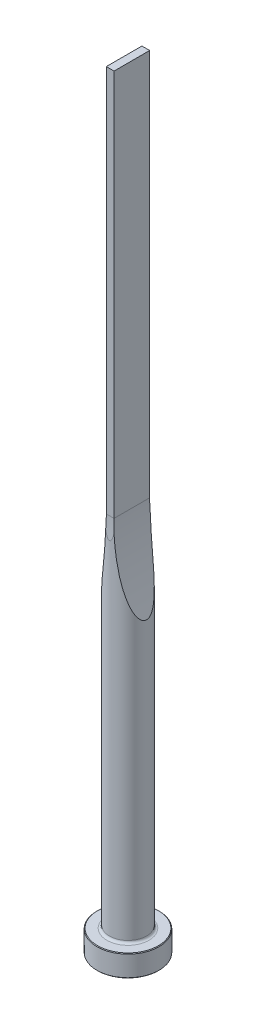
ISO-10303-21;
HEADER;
FILE_DESCRIPTION(('STEP AP214'),'2;1');
FILE_NAME('part.step','',(''),(''),'','','');
FILE_SCHEMA(('AUTOMOTIVE_DESIGN { 1 0 10303 214 1 1 1 1 }'));
ENDSEC;
DATA;
#1=APPLICATION_CONTEXT('core data for automotive mechanical design processes');
#2=APPLICATION_PROTOCOL_DEFINITION('international standard','automotive_design',2000,#1);
#3=PRODUCT_CONTEXT('',#1,'mechanical');
#4=PRODUCT('Part','Part','',(#3));
#5=PRODUCT_RELATED_PRODUCT_CATEGORY('part','',(#4));
#6=PRODUCT_DEFINITION_FORMATION('','',#4);
#7=PRODUCT_DEFINITION_CONTEXT('part definition',#1,'design');
#8=PRODUCT_DEFINITION('design','',#6,#7);
#9=PRODUCT_DEFINITION_SHAPE('','',#8);
#10=(LENGTH_UNIT() NAMED_UNIT(*) SI_UNIT(.MILLI.,.METRE.));
#11=(NAMED_UNIT(*) PLANE_ANGLE_UNIT() SI_UNIT($,.RADIAN.));
#12=(NAMED_UNIT(*) SI_UNIT($,.STERADIAN.) SOLID_ANGLE_UNIT());
#13=UNCERTAINTY_MEASURE_WITH_UNIT(LENGTH_MEASURE(1.E-05),#10,'distance_accuracy_value','');
#14=(GEOMETRIC_REPRESENTATION_CONTEXT(3) GLOBAL_UNCERTAINTY_ASSIGNED_CONTEXT((#13)) GLOBAL_UNIT_ASSIGNED_CONTEXT((#10,
#11,#12)) REPRESENTATION_CONTEXT('',''));
#15=CARTESIAN_POINT('',(0.,0.,0.));
#16=DIRECTION('',(0.,0.,1.));
#17=DIRECTION('',(1.,0.,0.));
#18=AXIS2_PLACEMENT_3D('',#15,#16,#17);
#19=CARTESIAN_POINT('',(0.,0.,0.));
#20=DIRECTION('',(0.,1.,0.));
#21=DIRECTION('',(-1.,0.,0.));
#22=AXIS2_PLACEMENT_3D('',#19,#20,#21);
#23=PLANE('',#22);
#24=CARTESIAN_POINT('',(0.,0.,0.));
#25=DIRECTION('',(0.,1.,0.));
#26=DIRECTION('',(-1.,0.,0.));
#27=AXIS2_PLACEMENT_3D('',#24,#25,#26);
#28=CIRCLE('',#27,9.8);
#29=CARTESIAN_POINT('',(-9.8,0.,0.));
#30=VERTEX_POINT('',#29);
#31=EDGE_CURVE('E133',#30,#30,#28,.T.);
#32=ORIENTED_EDGE('',*,*,#31,.F.);
#33=EDGE_LOOP('',(#32));
#34=FACE_BOUND('',#33,.T.);
#35=ADVANCED_FACE('F32',(#34),#23,.F.);
#36=CARTESIAN_POINT('',(0.,0.,0.));
#37=DIRECTION('',(0.,1.,0.));
#38=DIRECTION('',(-1.,0.,0.));
#39=AXIS2_PLACEMENT_3D('',#36,#37,#38);
#40=CONICAL_SURFACE('',#39,9.8,0.785398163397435);
#41=CARTESIAN_POINT('',(0.,0.200000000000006,0.));
#42=DIRECTION('',(0.,1.,0.));
#43=DIRECTION('',(-1.,0.,0.));
#44=AXIS2_PLACEMENT_3D('',#41,#42,#43);
#45=CIRCLE('',#44,10.);
#46=CARTESIAN_POINT('',(-10.,0.200000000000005,0.));
#47=VERTEX_POINT('',#46);
#48=EDGE_CURVE('E130',#47,#47,#45,.T.);
#49=ORIENTED_EDGE('',*,*,#48,.F.);
#50=EDGE_LOOP('',(#49));
#51=FACE_BOUND('',#50,.T.);
#52=ORIENTED_EDGE('',*,*,#31,.T.);
#53=EDGE_LOOP('',(#52));
#54=FACE_BOUND('',#53,.T.);
#55=ADVANCED_FACE('F171',(#51,#54),#40,.T.);
#56=CARTESIAN_POINT('',(0.,250.,0.));
#57=DIRECTION('',(0.,1.,0.));
#58=DIRECTION('',(-1.,0.,0.));
#59=AXIS2_PLACEMENT_3D('',#56,#57,#58);
#60=CYLINDRICAL_SURFACE('',#59,10.);
#61=CARTESIAN_POINT('',(0.,6.8,0.));
#62=DIRECTION('',(0.,1.,0.));
#63=DIRECTION('',(-1.,0.,0.));
#64=AXIS2_PLACEMENT_3D('',#61,#62,#63);
#65=CIRCLE('',#64,10.);
#66=CARTESIAN_POINT('',(-10.,6.8,0.));
#67=VERTEX_POINT('',#66);
#68=EDGE_CURVE('E127',#67,#67,#65,.T.);
#69=ORIENTED_EDGE('',*,*,#68,.F.);
#70=EDGE_LOOP('',(#69));
#71=FACE_BOUND('',#70,.T.);
#72=ORIENTED_EDGE('',*,*,#48,.T.);
#73=EDGE_LOOP('',(#72));
#74=FACE_BOUND('',#73,.T.);
#75=ADVANCED_FACE('F176',(#71,#74),#60,.T.);
#76=CARTESIAN_POINT('',(0.,6.8,0.));
#77=DIRECTION('',(0.,-1.,0.));
#78=DIRECTION('',(1.,0.,0.));
#79=AXIS2_PLACEMENT_3D('',#76,#77,#78);
#80=CONICAL_SURFACE('',#79,10.,0.785398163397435);
#81=CARTESIAN_POINT('',(0.,7.00000000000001,0.));
#82=DIRECTION('',(0.,1.,0.));
#83=DIRECTION('',(-1.,0.,0.));
#84=AXIS2_PLACEMENT_3D('',#81,#82,#83);
#85=CIRCLE('',#84,9.8);
#86=CARTESIAN_POINT('',(-9.8,7.00000000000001,0.));
#87=VERTEX_POINT('',#86);
#88=EDGE_CURVE('E124',#87,#87,#85,.T.);
#89=ORIENTED_EDGE('',*,*,#88,.F.);
#90=EDGE_LOOP('',(#89));
#91=FACE_BOUND('',#90,.T.);
#92=ORIENTED_EDGE('',*,*,#68,.T.);
#93=EDGE_LOOP('',(#92));
#94=FACE_BOUND('',#93,.T.);
#95=ADVANCED_FACE('F183',(#91,#94),#80,.T.);
#96=CARTESIAN_POINT('',(9.8,7.,0.));
#97=DIRECTION('',(0.,-1.,0.));
#98=DIRECTION('',(1.,0.,0.));
#99=AXIS2_PLACEMENT_3D('',#96,#97,#98);
#100=PLANE('',#99);
#101=CARTESIAN_POINT('',(0.,7.00000000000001,0.));
#102=DIRECTION('',(0.,1.,0.));
#103=DIRECTION('',(-1.,0.,0.));
#104=AXIS2_PLACEMENT_3D('',#101,#102,#103);
#105=CIRCLE('',#104,6.80000000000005);
#106=CARTESIAN_POINT('',(-6.80000000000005,7.00000000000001,0.));
#107=VERTEX_POINT('',#106);
#108=EDGE_CURVE('E121',#107,#107,#105,.T.);
#109=ORIENTED_EDGE('',*,*,#108,.F.);
#110=EDGE_LOOP('',(#109));
#111=FACE_BOUND('',#110,.T.);
#112=ORIENTED_EDGE('',*,*,#88,.T.);
#113=EDGE_LOOP('',(#112));
#114=FACE_BOUND('',#113,.T.);
#115=ADVANCED_FACE('F190',(#111,#114),#100,.F.);
#116=CARTESIAN_POINT('',(0.,7.8,0.));
#117=DIRECTION('',(0.,1.,0.));
#118=DIRECTION('',(-1.,0.,0.));
#119=AXIS2_PLACEMENT_3D('',#116,#117,#118);
#120=TOROIDAL_SURFACE('',#119,6.80000000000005,0.8);
#121=CARTESIAN_POINT('',(0.,7.8,0.));
#122=DIRECTION('',(0.,1.,0.));
#123=DIRECTION('',(-1.,0.,0.));
#124=AXIS2_PLACEMENT_3D('',#121,#122,#123);
#125=CIRCLE('',#124,6.00000000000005);
#126=CARTESIAN_POINT('',(-6.00000000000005,7.8,0.));
#127=VERTEX_POINT('',#126);
#128=EDGE_CURVE('E112',#127,#127,#125,.T.);
#129=ORIENTED_EDGE('',*,*,#128,.F.);
#130=EDGE_LOOP('',(#129));
#131=FACE_BOUND('',#130,.T.);
#132=ORIENTED_EDGE('',*,*,#108,.T.);
#133=EDGE_LOOP('',(#132));
#134=FACE_BOUND('',#133,.T.);
#135=ADVANCED_FACE('F168',(#131,#134),#120,.F.);
#136=CARTESIAN_POINT('',(0.,250.,0.));
#137=DIRECTION('',(0.,1.,0.));
#138=DIRECTION('',(-1.,0.,0.));
#139=AXIS2_PLACEMENT_3D('',#136,#137,#138);
#140=CYLINDRICAL_SURFACE('',#139,6.00000000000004);
#141=CARTESIAN_POINT('',(6.00000000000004,96.1480070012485,0.));
#142=CARTESIAN_POINT('',(5.99999252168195,96.1480280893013,0.122644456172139));
#143=CARTESIAN_POINT('',(5.99618793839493,96.1592631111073,0.245422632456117));
#144=CARTESIAN_POINT('',(5.98145295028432,96.2028583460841,0.486778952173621));
#145=CARTESIAN_POINT('',(5.9705076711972,96.2352626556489,0.605347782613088));
#146=CARTESIAN_POINT('',(5.93958053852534,96.3271009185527,0.861102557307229));
#147=CARTESIAN_POINT('',(5.91812144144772,96.3909703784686,0.996490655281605));
#148=CARTESIAN_POINT('',(5.86882600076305,96.5384269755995,1.2547024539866));
#149=CARTESIAN_POINT('',(5.84097779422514,96.6220508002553,1.37750215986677));
#150=CARTESIAN_POINT('',(5.78605390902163,96.7879416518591,1.59109296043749));
#151=CARTESIAN_POINT('',(5.75964606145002,96.8680402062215,1.68378290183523));
#152=CARTESIAN_POINT('',(5.70466987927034,97.0356606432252,1.86156052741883));
#153=CARTESIAN_POINT('',(5.67609999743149,97.1231878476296,1.946642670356));
#154=CARTESIAN_POINT('',(5.61738220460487,97.3040826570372,2.11011216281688));
#155=CARTESIAN_POINT('',(5.58723113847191,97.3974620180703,2.18848523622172));
#156=CARTESIAN_POINT('',(5.52586683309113,97.5886323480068,2.33910280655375));
#157=CARTESIAN_POINT('',(5.494653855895,97.686422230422,2.41134880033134));
#158=CARTESIAN_POINT('',(5.42118146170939,97.9180303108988,2.57314390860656));
#159=CARTESIAN_POINT('',(5.37864227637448,98.0531885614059,2.66064244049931));
#160=CARTESIAN_POINT('',(5.29281617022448,98.3282296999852,2.82752434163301));
#161=CARTESIAN_POINT('',(5.24952893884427,98.468114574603,2.90690424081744));
#162=CARTESIAN_POINT('',(5.16253997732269,98.7517378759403,3.05873243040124));
#163=CARTESIAN_POINT('',(5.118837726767,98.8954817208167,3.13117024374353));
#164=CARTESIAN_POINT('',(5.03135510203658,99.1858899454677,3.26989103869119));
#165=CARTESIAN_POINT('',(4.98757471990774,99.3325546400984,3.33617335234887));
#166=CARTESIAN_POINT('',(4.89994655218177,99.6289090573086,3.46360040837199));
#167=CARTESIAN_POINT('',(4.85609934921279,99.7786094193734,3.52472070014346));
#168=CARTESIAN_POINT('',(4.76868885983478,100.079979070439,3.64210927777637));
#169=CARTESIAN_POINT('',(4.72512558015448,100.231648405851,3.69837744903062));
#170=CARTESIAN_POINT('',(4.63844333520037,100.536489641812,3.80652609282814));
#171=CARTESIAN_POINT('',(4.59532398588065,100.689659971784,3.85841069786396));
#172=CARTESIAN_POINT('',(4.50957930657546,100.997397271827,3.95828528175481));
#173=CARTESIAN_POINT('',(4.46695397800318,101.151964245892,4.00627524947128));
#174=CARTESIAN_POINT('',(4.35547403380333,101.560496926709,4.1279949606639));
#175=CARTESIAN_POINT('',(4.28709072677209,101.815466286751,4.19879530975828));
#176=CARTESIAN_POINT('',(4.15206995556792,102.327972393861,4.33235742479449));
#177=CARTESIAN_POINT('',(4.08543269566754,102.585509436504,4.39511825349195));
#178=CARTESIAN_POINT('',(3.95405098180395,103.102773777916,4.51368089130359));
#179=CARTESIAN_POINT('',(3.8893073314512,103.362501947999,4.569479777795));
#180=CARTESIAN_POINT('',(3.76186381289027,103.883702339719,4.67495531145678));
#181=CARTESIAN_POINT('',(3.69916405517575,104.145174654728,4.72463162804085));
#182=CARTESIAN_POINT('',(3.51405122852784,104.932752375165,4.86576303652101));
#183=CARTESIAN_POINT('',(3.39486370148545,105.46107811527,4.94911108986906));
#184=CARTESIAN_POINT('',(3.16559819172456,106.522097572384,5.09879116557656));
#185=CARTESIAN_POINT('',(3.05552118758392,107.054791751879,5.16512136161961));
#186=CARTESIAN_POINT('',(2.89730686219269,107.857180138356,5.25445264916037));
#187=CARTESIAN_POINT('',(2.84564290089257,108.125627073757,5.2825720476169));
#188=CARTESIAN_POINT('',(2.74471435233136,108.663255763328,5.33570962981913));
#189=CARTESIAN_POINT('',(2.69544957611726,108.93243745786,5.36072805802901));
#190=CARTESIAN_POINT('',(2.5512764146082,109.74102766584,5.43161935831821));
#191=CARTESIAN_POINT('',(2.45999450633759,110.28145438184,5.47332531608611));
#192=CARTESIAN_POINT('',(2.28733028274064,111.363890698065,5.54769584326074));
#193=CARTESIAN_POINT('',(2.20593745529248,111.905897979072,5.58037006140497));
#194=CARTESIAN_POINT('',(2.05301992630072,112.991697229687,5.63842140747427));
#195=CARTESIAN_POINT('',(1.98149538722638,113.535489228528,5.66379841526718));
#196=CARTESIAN_POINT('',(1.84844546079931,114.623953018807,5.70860472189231));
#197=CARTESIAN_POINT('',(1.78690963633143,115.16862328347,5.72804024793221));
#198=CARTESIAN_POINT('',(1.67378553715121,116.259157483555,5.76211157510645));
#199=CARTESIAN_POINT('',(1.62219752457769,116.80502145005,5.77674724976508));
#200=CARTESIAN_POINT('',(1.5289951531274,117.897746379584,5.80211213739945));
#201=CARTESIAN_POINT('',(1.48738183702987,118.444607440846,5.81284094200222));
#202=CARTESIAN_POINT('',(1.41415608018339,119.539052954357,5.8310878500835));
#203=CARTESIAN_POINT('',(1.38254367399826,120.0866374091,5.8386059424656));
#204=CARTESIAN_POINT('',(1.32930623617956,121.182893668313,5.85095649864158));
#205=CARTESIAN_POINT('',(1.30769165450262,121.731566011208,5.85578615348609));
#206=CARTESIAN_POINT('',(1.27450748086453,122.829230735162,5.86309807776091));
#207=CARTESIAN_POINT('',(1.26293790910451,123.378223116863,5.86558034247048));
#208=CARTESIAN_POINT('',(1.24984893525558,124.476293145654,5.8683832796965));
#209=CARTESIAN_POINT('',(1.24832880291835,125.025370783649,5.86870410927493));
#210=CARTESIAN_POINT('',(1.25533745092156,126.123471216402,5.86720894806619));
#211=CARTESIAN_POINT('',(1.26386645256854,126.672494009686,5.86539291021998));
#212=CARTESIAN_POINT('',(1.29090061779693,127.767455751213,5.85950219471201));
#213=CARTESIAN_POINT('',(1.3093542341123,128.313396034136,5.8554391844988));
#214=CARTESIAN_POINT('',(1.35619619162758,129.404812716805,5.8447676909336));
#215=CARTESIAN_POINT('',(1.3845842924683,129.950289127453,5.838159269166));
#216=CARTESIAN_POINT('',(1.45128701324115,131.040655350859,5.82193652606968));
#217=CARTESIAN_POINT('',(1.48960280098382,131.585545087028,5.81232185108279));
#218=CARTESIAN_POINT('',(1.57614113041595,132.674460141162,5.78945448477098));
#219=CARTESIAN_POINT('',(1.62436362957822,133.218485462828,5.77620180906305));
#220=CARTESIAN_POINT('',(1.73063067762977,134.304840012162,5.74525700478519));
#221=CARTESIAN_POINT('',(1.78866423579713,134.847170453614,5.72756983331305));
#222=CARTESIAN_POINT('',(1.91455588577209,135.930497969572,5.68672649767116));
#223=CARTESIAN_POINT('',(1.98241415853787,136.471495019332,5.66357023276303));
#224=CARTESIAN_POINT('',(2.12788564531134,137.551720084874,5.6105344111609));
#225=CARTESIAN_POINT('',(2.20549657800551,138.090948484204,5.58065642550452));
#226=CARTESIAN_POINT('',(2.37040873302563,139.167381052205,5.51263391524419));
#227=CARTESIAN_POINT('',(2.4577093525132,139.704585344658,5.47448990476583));
#228=CARTESIAN_POINT('',(2.59201282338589,140.486234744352,5.41143537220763));
#229=CARTESIAN_POINT('',(2.63523328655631,140.731661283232,5.39054625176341));
#230=CARTESIAN_POINT('',(2.72367149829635,141.221936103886,5.34640580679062));
#231=CARTESIAN_POINT('',(2.76888920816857,141.466784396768,5.32315452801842));
#232=CARTESIAN_POINT('',(2.90752176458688,142.200414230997,5.24950501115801));
#233=CARTESIAN_POINT('',(3.00391198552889,142.688257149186,5.1952129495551));
#234=CARTESIAN_POINT('',(3.20489967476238,143.663041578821,5.07370413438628));
#235=CARTESIAN_POINT('',(3.30953321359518,144.149968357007,5.00642847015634));
#236=CARTESIAN_POINT('',(3.52630573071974,145.119644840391,4.85619318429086));
#237=CARTESIAN_POINT('',(3.63844279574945,145.602395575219,4.77323755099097));
#238=CARTESIAN_POINT('',(3.81257994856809,146.325101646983,4.63355313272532));
#239=CARTESIAN_POINT('',(3.8719615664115,146.567109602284,4.58413142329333));
#240=CARTESIAN_POINT('',(3.99243307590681,147.049462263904,4.47960383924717));
#241=CARTESIAN_POINT('',(4.0535228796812,147.289807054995,4.42449825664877));
#242=CARTESIAN_POINT('',(4.17737477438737,147.768821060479,4.30775940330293));
#243=CARTESIAN_POINT('',(4.240138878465,148.00748777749,4.24611798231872));
#244=CARTESIAN_POINT('',(4.36710464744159,148.482395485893,4.1154224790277));
#245=CARTESIAN_POINT('',(4.43130623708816,148.718636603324,4.04636878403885));
#246=CARTESIAN_POINT('',(4.5604331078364,149.186305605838,3.90024206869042));
#247=CARTESIAN_POINT('',(4.62534899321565,149.417756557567,3.82323498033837));
#248=CARTESIAN_POINT('',(4.75610292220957,149.876952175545,3.65930202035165));
#249=CARTESIAN_POINT('',(4.82194117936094,150.104695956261,3.57237381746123));
#250=CARTESIAN_POINT('',(4.95392961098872,150.554707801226,3.38696166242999));
#251=CARTESIAN_POINT('',(5.02007870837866,150.776987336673,3.28850496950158));
#252=CARTESIAN_POINT('',(5.15215404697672,151.214748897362,3.07747340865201));
#253=CARTESIAN_POINT('',(5.21808040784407,151.430235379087,2.96490804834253));
#254=CARTESIAN_POINT('',(5.31394944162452,151.739595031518,2.78676803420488));
#255=CARTESIAN_POINT('',(5.34439862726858,151.837247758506,2.72800628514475));
#256=CARTESIAN_POINT('',(5.40485413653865,152.030004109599,2.6061820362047));
#257=CARTESIAN_POINT('',(5.43486041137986,152.125107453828,2.54311906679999));
#258=CARTESIAN_POINT('',(5.49425843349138,152.312312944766,2.41211667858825));
#259=CARTESIAN_POINT('',(5.52364932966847,152.404411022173,2.3441710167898));
#260=CARTESIAN_POINT('',(5.58148621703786,152.584682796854,2.20291205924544));
#261=CARTESIAN_POINT('',(5.60993234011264,152.672857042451,2.12959951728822));
#262=CARTESIAN_POINT('',(5.68541013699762,152.905639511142,1.92239994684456));
#263=CARTESIAN_POINT('',(5.73120270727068,153.045567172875,1.7826521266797));
#264=CARTESIAN_POINT('',(5.81613449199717,153.303231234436,1.48216093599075));
#265=CARTESIAN_POINT('',(5.85529370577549,153.42103445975,1.32148335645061));
#266=CARTESIAN_POINT('',(5.90938819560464,153.582936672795,1.04430418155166));
#267=CARTESIAN_POINT('',(5.92782413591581,153.637889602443,0.934890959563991));
#268=CARTESIAN_POINT('',(5.95913398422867,153.731003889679,0.708345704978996));
#269=CARTESIAN_POINT('',(5.97201429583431,153.769184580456,0.591222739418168));
#270=CARTESIAN_POINT('',(5.99098805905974,153.825367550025,0.35035845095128));
#271=CARTESIAN_POINT('',(5.99701510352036,153.843172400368,0.226564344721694));
#272=CARTESIAN_POINT('',(6.00124661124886,153.855677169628,-0.0223197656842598));
#273=CARTESIAN_POINT('',(5.99945446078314,153.850387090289,-0.14740918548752));
#274=CARTESIAN_POINT('',(5.98897538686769,153.819401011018,-0.379606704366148));
#275=CARTESIAN_POINT('',(5.9811236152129,153.79617655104,-0.487100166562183));
#276=CARTESIAN_POINT('',(5.96030773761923,153.734464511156,-0.697052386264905));
#277=CARTESIAN_POINT('',(5.94734054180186,153.69596770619,-0.799508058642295));
#278=CARTESIAN_POINT('',(5.90966135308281,153.583764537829,-1.04821727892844));
#279=CARTESIAN_POINT('',(5.88232531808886,153.502095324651,-1.19045464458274));
#280=CARTESIAN_POINT('',(5.82133461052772,153.318765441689,-1.45989343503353));
#281=CARTESIAN_POINT('',(5.7876624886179,153.217049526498,-1.58705171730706));
#282=CARTESIAN_POINT('',(5.72023684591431,153.011961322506,-1.81419145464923));
#283=CARTESIAN_POINT('',(5.68690674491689,152.910024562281,-1.91562288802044));
#284=CARTESIAN_POINT('',(5.61807166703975,152.698109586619,-2.10898431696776));
#285=CARTESIAN_POINT('',(5.58256487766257,152.588124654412,-2.20090621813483));
#286=CARTESIAN_POINT('',(5.51006275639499,152.361968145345,-2.37660535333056));
#287=CARTESIAN_POINT('',(5.47306450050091,152.245784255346,-2.4603653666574));
#288=CARTESIAN_POINT('',(5.39817254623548,152.008872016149,-2.62059961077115));
#289=CARTESIAN_POINT('',(5.36027914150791,151.888145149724,-2.69707619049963));
#290=CARTESIAN_POINT('',(5.26718075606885,151.589262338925,-2.87593311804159));
#291=CARTESIAN_POINT('',(5.21168426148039,151.409178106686,-2.97493259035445));
#292=CARTESIAN_POINT('',(5.10029937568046,151.043534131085,-3.16208569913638));
#293=CARTESIAN_POINT('',(5.04441080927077,150.857971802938,-3.25023411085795));
#294=CARTESIAN_POINT('',(4.93265417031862,150.482430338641,-3.4174622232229));
#295=CARTESIAN_POINT('',(4.87678628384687,150.292444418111,-3.49652671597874));
#296=CARTESIAN_POINT('',(4.76549494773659,149.909239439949,-3.64675072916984));
#297=CARTESIAN_POINT('',(4.71007154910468,149.716020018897,-3.71790935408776));
#298=CARTESIAN_POINT('',(4.59964672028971,149.326067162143,-3.85369192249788));
#299=CARTESIAN_POINT('',(4.54464863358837,149.129321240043,-3.9182825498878));
#300=CARTESIAN_POINT('',(4.43552311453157,148.733704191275,-4.04139805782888));
#301=CARTESIAN_POINT('',(4.38139570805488,148.53483300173,-4.09992275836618));
#302=CARTESIAN_POINT('',(4.27420253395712,148.135542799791,-4.21155238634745));
#303=CARTESIAN_POINT('',(4.22113568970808,147.935125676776,-4.26466306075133));
#304=CARTESIAN_POINT('',(4.1161045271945,147.532809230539,-4.36612054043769));
#305=CARTESIAN_POINT('',(4.06414020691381,147.330909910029,-4.41446735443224));
#306=CARTESIAN_POINT('',(3.92557394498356,146.784635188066,-4.53912486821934));
#307=CARTESIAN_POINT('',(3.84008066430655,146.439061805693,-4.61143245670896));
#308=CARTESIAN_POINT('',(3.67276769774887,145.745020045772,-4.74576314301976));
#309=CARTESIAN_POINT('',(3.5909484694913,145.396551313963,-4.80778496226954));
#310=CARTESIAN_POINT('',(3.43114676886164,144.697150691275,-4.9231028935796));
#311=CARTESIAN_POINT('',(3.35316590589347,144.346217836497,-4.97639536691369));
#312=CARTESIAN_POINT('',(3.20120804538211,143.642420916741,-5.07547918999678));
#313=CARTESIAN_POINT('',(3.12723126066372,143.289556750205,-5.12127014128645));
#314=CARTESIAN_POINT('',(2.98323529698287,142.581496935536,-5.20646913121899));
#315=CARTESIAN_POINT('',(2.91322451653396,142.226297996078,-5.24586393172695));
#316=CARTESIAN_POINT('',(2.77739408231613,141.514517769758,-5.31902413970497));
#317=CARTESIAN_POINT('',(2.71157455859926,141.157936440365,-5.35278937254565));
#318=CARTESIAN_POINT('',(2.52051939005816,140.086596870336,-5.44676258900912));
#319=CARTESIAN_POINT('',(2.40164783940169,139.370049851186,-5.49967045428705));
#320=CARTESIAN_POINT('',(2.1809775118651,137.932107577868,-5.59084552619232));
#321=CARTESIAN_POINT('',(2.07921035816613,137.210705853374,-5.62908577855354));
#322=CARTESIAN_POINT('',(1.89316918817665,135.765123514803,-5.69435012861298));
#323=CARTESIAN_POINT('',(1.80889591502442,135.040942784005,-5.72137374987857));
#324=CARTESIAN_POINT('',(1.65803395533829,133.591282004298,-5.76689841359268));
#325=CARTESIAN_POINT('',(1.59142610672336,132.865804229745,-5.78540870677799));
#326=CARTESIAN_POINT('',(1.4758382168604,131.413319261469,-5.81596576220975));
#327=CARTESIAN_POINT('',(1.4268581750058,130.686312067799,-5.82801252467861));
#328=CARTESIAN_POINT('',(1.33557886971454,129.032134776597,-5.84970538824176));
#329=CARTESIAN_POINT('',(1.29877643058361,128.104636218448,-5.85779222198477));
#330=CARTESIAN_POINT('',(1.25387900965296,126.248889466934,-5.86756279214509));
#331=CARTESIAN_POINT('',(1.24578503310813,125.320641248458,-5.86924630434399));
#332=CARTESIAN_POINT('',(1.25832051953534,123.463635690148,-5.866573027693));
#333=CARTESIAN_POINT('',(1.27897187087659,122.534878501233,-5.86221163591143));
#334=CARTESIAN_POINT('',(1.34901175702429,120.67853721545,-5.8464903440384));
#335=CARTESIAN_POINT('',(1.3983994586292,119.750953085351,-5.83513064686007));
#336=CARTESIAN_POINT('',(1.52563647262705,117.901045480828,-5.80316878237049));
#337=CARTESIAN_POINT('',(1.60338814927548,116.978714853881,-5.78259826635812));
#338=CARTESIAN_POINT('',(1.7412896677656,115.59761129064,-5.74196407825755));
#339=CARTESIAN_POINT('',(1.79080682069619,115.137609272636,-5.7267881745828));
#340=CARTESIAN_POINT('',(1.89690986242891,114.218569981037,-5.69252641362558));
#341=CARTESIAN_POINT('',(1.95349560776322,113.759532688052,-5.67344063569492));
#342=CARTESIAN_POINT('',(2.07364787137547,112.843042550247,-5.63063453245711));
#343=CARTESIAN_POINT('',(2.1372075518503,112.385588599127,-5.60691872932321));
#344=CARTESIAN_POINT('',(2.27130980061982,111.472035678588,-5.55394928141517));
#345=CARTESIAN_POINT('',(2.34185216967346,111.015936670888,-5.5246957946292));
#346=CARTESIAN_POINT('',(2.48984878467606,110.105429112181,-5.45959598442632));
#347=CARTESIAN_POINT('',(2.56730155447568,109.651020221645,-5.42375106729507));
#348=CARTESIAN_POINT('',(2.72904946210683,108.74412592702,-5.34419515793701));
#349=CARTESIAN_POINT('',(2.8133442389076,108.291640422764,-5.30048458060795));
#350=CARTESIAN_POINT('',(2.96709144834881,107.500050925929,-5.21555922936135));
#351=CARTESIAN_POINT('',(3.03509178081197,107.160446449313,-5.17637720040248));
#352=CARTESIAN_POINT('',(3.17485079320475,106.482770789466,-5.09185601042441));
#353=CARTESIAN_POINT('',(3.24660950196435,106.14469961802,-5.04651680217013));
#354=CARTESIAN_POINT('',(3.39372907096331,105.470674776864,-4.94877727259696));
#355=CARTESIAN_POINT('',(3.46908674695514,105.13471952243,-4.89638312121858));
#356=CARTESIAN_POINT('',(3.62333606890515,104.4650098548,-4.78336577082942));
#357=CARTESIAN_POINT('',(3.70222757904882,104.131255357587,-4.72274288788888));
#358=CARTESIAN_POINT('',(3.83929146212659,103.565785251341,-4.61141276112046));
#359=CARTESIAN_POINT('',(3.89661078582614,103.333379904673,-4.56315560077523));
#360=CARTESIAN_POINT('',(4.01281641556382,102.870137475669,-4.46130900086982));
#361=CARTESIAN_POINT('',(4.07170266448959,102.639300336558,-4.40771975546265));
#362=CARTESIAN_POINT('',(4.19104857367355,102.17905356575,-4.29440309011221));
#363=CARTESIAN_POINT('',(4.2515109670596,101.949647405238,-4.23466439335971));
#364=CARTESIAN_POINT('',(4.3737574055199,101.493100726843,-4.10828145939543));
#365=CARTESIAN_POINT('',(4.43554140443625,101.265960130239,-4.04163746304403));
#366=CARTESIAN_POINT('',(4.5669153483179,100.790290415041,-3.89283650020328));
#367=CARTESIAN_POINT('',(4.63663289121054,100.542074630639,-3.80978259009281));
#368=CARTESIAN_POINT('',(4.77710170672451,100.04998340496,-3.63209895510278));
#369=CARTESIAN_POINT('',(4.84785329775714,99.806109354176,-3.53746559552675));
#370=CARTESIAN_POINT('',(4.98957510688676,99.3250753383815,-3.33457940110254));
#371=CARTESIAN_POINT('',(5.06054393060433,99.0878966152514,-3.22637048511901));
#372=CARTESIAN_POINT('',(5.20199383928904,98.6219838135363,-2.99297983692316));
#373=CARTESIAN_POINT('',(5.27247528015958,98.3932428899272,-2.86781226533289));
#374=CARTESIAN_POINT('',(5.39502311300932,98.0008395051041,-2.62816839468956));
#375=CARTESIAN_POINT('',(5.44749923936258,97.8345893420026,-2.51817503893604));
#376=CARTESIAN_POINT('',(5.55029648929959,97.512012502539,-2.28270917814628));
#377=CARTESIAN_POINT('',(5.60061350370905,97.3557044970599,-2.15720878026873));
#378=CARTESIAN_POINT('',(5.69770401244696,97.0566717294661,-1.8860604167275));
#379=CARTESIAN_POINT('',(5.74443119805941,96.9141198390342,-1.74020139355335));
#380=CARTESIAN_POINT('',(5.83039285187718,96.6537596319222,-1.42578179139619));
#381=CARTESIAN_POINT('',(5.86965408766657,96.5358627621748,-1.25730615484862));
#382=CARTESIAN_POINT('',(5.92189290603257,96.3797632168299,-0.97096059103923));
#383=CARTESIAN_POINT('',(5.93903183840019,96.3287478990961,-0.86088461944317));
#384=CARTESIAN_POINT('',(5.96754078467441,96.2440587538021,-0.633614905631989));
#385=CARTESIAN_POINT('',(5.97892566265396,96.2103402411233,-0.516440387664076));
#386=CARTESIAN_POINT('',(5.99117669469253,96.1740876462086,-0.331820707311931));
#387=CARTESIAN_POINT('',(5.99447157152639,96.164346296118,-0.26589904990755));
#388=CARTESIAN_POINT('',(5.99888554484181,96.1512993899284,-0.133331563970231));
#389=CARTESIAN_POINT('',(6.00000406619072,96.1479955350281,-0.0666855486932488));
#390=CARTESIAN_POINT('',(6.00000000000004,96.1480070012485,0.));
#391=B_SPLINE_CURVE_WITH_KNOTS('',3,(#141,#142,#143,#144,#145,#146,#147,#148,#149,#150,#151,
#152,#153,#154,#155,#156,#157,#158,#159,#160,#161,#162,#163,#164,#165,#166,#167,#168,#169,#170,
#171,#172,#173,#174,#175,#176,#177,#178,#179,#180,#181,#182,#183,#184,#185,#186,#187,#188,#189,
#190,#191,#192,#193,#194,#195,#196,#197,#198,#199,#200,#201,#202,#203,#204,#205,#206,#207,#208,
#209,#210,#211,#212,#213,#214,#215,#216,#217,#218,#219,#220,#221,#222,#223,#224,#225,#226,#227,
#228,#229,#230,#231,#232,#233,#234,#235,#236,#237,#238,#239,#240,#241,#242,#243,#244,#245,#246,
#247,#248,#249,#250,#251,#252,#253,#254,#255,#256,#257,#258,#259,#260,#261,#262,#263,#264,#265,
#266,#267,#268,#269,#270,#271,#272,#273,#274,#275,#276,#277,#278,#279,#280,#281,#282,#283,#284,
#285,#286,#287,#288,#289,#290,#291,#292,#293,#294,#295,#296,#297,#298,#299,#300,#301,#302,#303,
#304,#305,#306,#307,#308,#309,#310,#311,#312,#313,#314,#315,#316,#317,#318,#319,#320,#321,#322,
#323,#324,#325,#326,#327,#328,#329,#330,#331,#332,#333,#334,#335,#336,#337,#338,#339,#340,#341,
#342,#343,#344,#345,#346,#347,#348,#349,#350,#351,#352,#353,#354,#355,#356,#357,#358,#359,#360,
#361,#362,#363,#364,#365,#366,#367,#368,#369,#370,#371,#372,#373,#374,#375,#376,#377,#378,#379,
#380,#381,#382,#383,#384,#385,#386,#387,#388,#389,#390),.UNSPECIFIED.,.T.,.F.,(4,2,2,2,2,2,2,2,
2,2,2,2,2,2,2,2,2,2,2,2,2,2,2,2,2,2,2,2,2,2,2,2,2,2,2,2,2,2,2,2,2,2,2,2,2,2,2,2,2,2,2,2,2,2,2,2,
2,2,2,2,2,2,2,2,2,2,2,2,2,2,2,2,2,2,2,2,2,2,2,2,2,2,2,2,2,2,2,2,2,2,2,2,2,2,2,2,2,2,2,2,2,2,2,2,
2,2,2,2,2,2,2,2,2,2,2,2,2,2,2,2,2,2,2,2,4),(0.,0.367632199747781,0.736032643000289,
1.18715483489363,1.63912152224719,2.01454826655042,2.39024626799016,2.76672480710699,
3.14311110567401,3.64236820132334,4.14183780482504,4.64204971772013,5.14231584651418,
5.64483223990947,6.14736049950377,6.64940960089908,7.15146013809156,7.97121717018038,
8.79106968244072,9.61126521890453,10.4315050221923,12.0749599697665,13.7185912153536,
14.543012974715,15.3673696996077,17.0161659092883,18.6631938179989,20.3102488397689,
21.9555716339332,23.6009377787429,25.2464758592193,26.8920196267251,28.5392794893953,
30.1865426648,31.8336861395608,33.4808658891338,35.1195718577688,36.7582381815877,
38.3970973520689,40.03594948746,41.6729777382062,43.3100361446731,44.9467123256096,
46.5832867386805,47.3335008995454,48.0837005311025,49.5841717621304,51.0916183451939,
52.5986820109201,53.3607433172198,54.122765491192,54.8857493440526,55.6486933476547,
56.4057552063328,57.1629953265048,57.9184797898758,58.6734578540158,59.027272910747,
59.3811266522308,59.7354411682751,60.0897060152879,60.6970359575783,61.3025009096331,
61.6727478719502,62.042566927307,62.4159397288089,62.7891508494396,63.1184957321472,
63.4480398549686,63.9440333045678,64.4414132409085,64.8836162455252,65.3261926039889,
65.7696834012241,66.213030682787,66.8511576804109,67.4895907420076,68.1290775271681,
68.7686366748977,69.4112931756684,70.0539687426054,70.6959548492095,71.3379397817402,
72.4274960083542,73.5171875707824,74.6073322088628,75.6975347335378,76.7899656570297,
77.8824304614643,80.0667651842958,82.255094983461,84.4435177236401,86.6295568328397,
88.8155958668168,91.599896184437,94.3842939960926,97.1708131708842,99.9572515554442,
102.734187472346,104.122854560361,105.511493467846,106.898782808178,108.286032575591,
109.672986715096,111.059867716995,112.105464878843,113.151070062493,114.195766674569,
115.240423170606,115.97292129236,116.705392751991,117.439232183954,118.173046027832,
118.985414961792,119.798039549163,120.608099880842,121.417487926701,122.035280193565,
122.654200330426,123.280093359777,123.90369823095,124.270054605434,124.635459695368,
124.835299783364,125.035192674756),.UNSPECIFIED.);
#392=CARTESIAN_POINT('',(1.34687364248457,120.825329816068,-5.84687364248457));
#393=VERTEX_POINT('',#392);
#394=CARTESIAN_POINT('',(1.34687364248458,120.825329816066,5.84687364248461));
#395=VERTEX_POINT('',#394);
#396=EDGE_CURVE('E138',#393,#395,#391,.T.);
#397=ORIENTED_EDGE('',*,*,#396,.T.);
#398=CARTESIAN_POINT('',(-1.71391365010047,125.,5.74999999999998));
#399=CARTESIAN_POINT('',(-1.71391988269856,125.360232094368,5.75000022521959));
#400=CARTESIAN_POINT('',(-1.70670690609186,125.7204849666,5.75216429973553));
#401=CARTESIAN_POINT('',(-1.67730271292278,126.440311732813,5.76080572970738));
#402=CARTESIAN_POINT('',(-1.65511191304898,126.799885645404,5.7672829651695));
#403=CARTESIAN_POINT('',(-1.59385315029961,127.518394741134,5.78452322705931));
#404=CARTESIAN_POINT('',(-1.55474710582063,127.87732663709,5.7952959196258));
#405=CARTESIAN_POINT('',(-1.4803367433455,128.41327242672,5.8145701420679));
#406=CARTESIAN_POINT('',(-1.45292096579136,128.591447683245,5.82151097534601));
#407=CARTESIAN_POINT('',(-1.39191289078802,128.946689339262,5.83640137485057));
#408=CARTESIAN_POINT('',(-1.35832152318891,129.123755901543,5.8443507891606));
#409=CARTESIAN_POINT('',(-1.29127878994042,129.440079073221,5.85948118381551));
#410=CARTESIAN_POINT('',(-1.25921382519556,129.579636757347,5.86648499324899));
#411=CARTESIAN_POINT('',(-1.18926063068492,129.857383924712,5.88106678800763));
#412=CARTESIAN_POINT('',(-1.15136840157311,129.995572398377,5.88864516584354));
#413=CARTESIAN_POINT('',(-1.06831244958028,130.269233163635,5.90427715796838));
#414=CARTESIAN_POINT('',(-1.02317340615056,130.404712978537,5.91232910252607));
#415=CARTESIAN_POINT('',(-0.923002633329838,130.671884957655,5.92880254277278));
#416=CARTESIAN_POINT('',(-0.867986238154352,130.803582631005,5.93722345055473));
#417=CARTESIAN_POINT('',(-0.766634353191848,131.011378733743,5.95094792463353));
#418=CARTESIAN_POINT('',(-0.724867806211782,131.089690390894,5.95622768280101));
#419=CARTESIAN_POINT('',(-0.633381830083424,131.241543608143,5.96665610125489));
#420=CARTESIAN_POINT('',(-0.58368196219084,131.315096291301,5.97180504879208));
#421=CARTESIAN_POINT('',(-0.500547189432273,131.418351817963,5.97914745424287));
#422=CARTESIAN_POINT('',(-0.471478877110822,131.451525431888,5.98152654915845));
#423=CARTESIAN_POINT('',(-0.409756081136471,131.514467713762,5.98607241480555));
#424=CARTESIAN_POINT('',(-0.377102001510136,131.54423676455,5.98823920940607));
#425=CARTESIAN_POINT('',(-0.314953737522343,131.592746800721,5.99179060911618));
#426=CARTESIAN_POINT('',(-0.286256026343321,131.612487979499,5.99324366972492));
#427=CARTESIAN_POINT('',(-0.226115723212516,131.647269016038,5.99581280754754));
#428=CARTESIAN_POINT('',(-0.194679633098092,131.662319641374,5.9969296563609));
#429=CARTESIAN_POINT('',(-0.137318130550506,131.683161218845,5.99847946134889));
#430=CARTESIAN_POINT('',(-0.11189510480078,131.690310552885,5.99901243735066));
#431=CARTESIAN_POINT('',(-0.0602062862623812,131.700243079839,5.99975337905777));
#432=CARTESIAN_POINT('',(-0.0339414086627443,131.703030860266,5.99996168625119));
#433=CARTESIAN_POINT('',(0.0187279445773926,131.703927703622,6.00002867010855));
#434=CARTESIAN_POINT('',(0.0451325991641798,131.702026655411,5.99988659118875));
#435=CARTESIAN_POINT('',(0.0972283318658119,131.693750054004,5.999268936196));
#436=CARTESIAN_POINT('',(0.122918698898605,131.687370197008,5.99879303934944));
#437=CARTESIAN_POINT('',(0.180222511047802,131.668376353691,5.99737959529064));
#438=CARTESIAN_POINT('',(0.211408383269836,131.654495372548,5.9963485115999));
#439=CARTESIAN_POINT('',(0.271170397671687,131.62198630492,5.99394413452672));
#440=CARTESIAN_POINT('',(0.299740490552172,131.603347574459,5.99257007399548));
#441=CARTESIAN_POINT('',(0.373829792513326,131.548222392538,5.988527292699));
#442=CARTESIAN_POINT('',(0.416890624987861,131.508492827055,5.98563453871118));
#443=CARTESIAN_POINT('',(0.497042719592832,131.423494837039,5.97951175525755));
#444=CARTESIAN_POINT('',(0.534115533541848,131.378210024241,5.97628073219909));
#445=CARTESIAN_POINT('',(0.61988723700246,131.262394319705,5.96811343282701));
#446=CARTESIAN_POINT('',(0.665945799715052,131.189938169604,5.96308457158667));
#447=CARTESIAN_POINT('',(0.751194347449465,131.041041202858,5.95294302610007));
#448=CARTESIAN_POINT('',(0.790368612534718,130.964591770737,5.94783017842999));
#449=CARTESIAN_POINT('',(0.86373240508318,130.808846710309,5.93762100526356));
#450=CARTESIAN_POINT('',(0.897893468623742,130.72953779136,5.93252492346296));
#451=CARTESIAN_POINT('',(0.962086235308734,130.569384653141,5.92245190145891));
#452=CARTESIAN_POINT('',(0.992122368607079,130.488542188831,5.91747483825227));
#453=CARTESIAN_POINT('',(1.07256047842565,130.257924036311,5.90359472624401));
#454=CARTESIAN_POINT('',(1.11909878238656,130.106793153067,5.89487290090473));
#455=CARTESIAN_POINT('',(1.20416724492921,129.8022314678,5.87808063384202));
#456=CARTESIAN_POINT('',(1.2426926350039,129.648799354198,5.87001058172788));
#457=CARTESIAN_POINT('',(1.31348491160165,129.340145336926,5.85457710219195));
#458=CARTESIAN_POINT('',(1.34573891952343,129.184920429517,5.84721514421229));
#459=CARTESIAN_POINT('',(1.40500539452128,128.873431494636,5.83325598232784));
#460=CARTESIAN_POINT('',(1.43201709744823,128.717167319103,5.8266588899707));
#461=CARTESIAN_POINT('',(1.50637758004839,128.247239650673,5.80805390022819));
#462=CARTESIAN_POINT('',(1.54704655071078,127.932464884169,5.79723348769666));
#463=CARTESIAN_POINT('',(1.61419698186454,127.301766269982,5.77888587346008));
#464=CARTESIAN_POINT('',(1.6406953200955,126.985844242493,5.77135475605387));
#465=CARTESIAN_POINT('',(1.68834801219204,126.246171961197,5.75763237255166));
#466=CARTESIAN_POINT('',(1.70466595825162,125.822080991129,5.75275515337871));
#467=CARTESIAN_POINT('',(1.71726032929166,124.973290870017,5.74900212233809));
#468=CARTESIAN_POINT('',(1.71352141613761,124.548591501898,5.75013090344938));
#469=CARTESIAN_POINT('',(1.68556859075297,123.699396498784,5.75839581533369));
#470=CARTESIAN_POINT('',(1.66133235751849,123.274901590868,5.76553849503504));
#471=CARTESIAN_POINT('',(1.60743023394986,122.639971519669,5.78069922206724));
#472=CARTESIAN_POINT('',(1.58655066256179,122.42871844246,5.78649055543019));
#473=CARTESIAN_POINT('',(1.53819978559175,122.007023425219,5.79953269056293));
#474=CARTESIAN_POINT('',(1.51072919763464,121.796581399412,5.80678333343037));
#475=CARTESIAN_POINT('',(1.44802861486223,121.37621673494,5.82273739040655));
#476=CARTESIAN_POINT('',(1.41277459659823,121.166297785,5.83144528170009));
#477=CARTESIAN_POINT('',(1.33275702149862,120.748030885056,5.85025220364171));
#478=CARTESIAN_POINT('',(1.28798068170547,120.539685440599,5.86035309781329));
#479=CARTESIAN_POINT('',(1.18625496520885,120.12669527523,5.88179991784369));
#480=CARTESIAN_POINT('',(1.12934956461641,119.922040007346,5.89314127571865));
#481=CARTESIAN_POINT('',(1.03065050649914,119.619678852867,5.91090853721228));
#482=CARTESIAN_POINT('',(0.995571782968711,119.519766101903,5.91694999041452));
#483=CARTESIAN_POINT('',(0.919681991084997,119.322175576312,5.92922251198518));
#484=CARTESIAN_POINT('',(0.878874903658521,119.224496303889,5.93545344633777));
#485=CARTESIAN_POINT('',(0.789300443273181,119.032115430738,5.94803051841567));
#486=CARTESIAN_POINT('',(0.740485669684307,118.937435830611,5.9543771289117));
#487=CARTESIAN_POINT('',(0.63184354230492,118.754833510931,5.96689426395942));
#488=CARTESIAN_POINT('',(0.572086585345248,118.666872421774,5.97306563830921));
#489=CARTESIAN_POINT('',(0.479606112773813,118.55794854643,5.98084712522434));
#490=CARTESIAN_POINT('',(0.454538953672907,118.530582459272,5.98281596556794));
#491=CARTESIAN_POINT('',(0.401755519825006,118.478381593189,5.98659336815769));
#492=CARTESIAN_POINT('',(0.374034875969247,118.453551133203,5.98840165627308));
#493=CARTESIAN_POINT('',(0.315263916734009,118.407326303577,5.99178479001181));
#494=CARTESIAN_POINT('',(0.28417871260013,118.38597512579,5.99335668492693));
#495=CARTESIAN_POINT('',(0.218804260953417,118.348886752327,5.9960973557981));
#496=CARTESIAN_POINT('',(0.184526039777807,118.333131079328,5.99726745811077));
#497=CARTESIAN_POINT('',(0.124190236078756,118.312996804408,5.99876570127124));
#498=CARTESIAN_POINT('',(0.0988107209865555,118.30661433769,5.99924175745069));
#499=CARTESIAN_POINT('',(0.0473358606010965,118.298218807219,5.99986825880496));
#500=CARTESIAN_POINT('',(0.0212412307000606,118.296201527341,6.00001901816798));
#501=CARTESIAN_POINT('',(-0.0309265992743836,118.296763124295,5.99997707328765));
#502=CARTESIAN_POINT('',(-0.0569997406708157,118.299347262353,5.9997839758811));
#503=CARTESIAN_POINT('',(-0.10834680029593,118.30882588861,5.99907682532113));
#504=CARTESIAN_POINT('',(-0.133619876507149,118.315724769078,5.99856244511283));
#505=CARTESIAN_POINT('',(-0.191093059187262,118.336109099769,5.99704633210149));
#506=CARTESIAN_POINT('',(-0.222776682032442,118.351026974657,5.9959390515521));
#507=CARTESIAN_POINT('',(-0.283384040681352,118.385644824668,5.9933812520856));
#508=CARTESIAN_POINT('',(-0.312301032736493,118.405356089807,5.99192992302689));
#509=CARTESIAN_POINT('',(-0.388084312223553,118.46405166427,5.98763173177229));
#510=CARTESIAN_POINT('',(-0.432258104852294,118.506448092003,5.98455118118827));
#511=CARTESIAN_POINT('',(-0.514319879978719,118.596851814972,5.97805681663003));
#512=CARTESIAN_POINT('',(-0.552188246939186,118.644875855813,5.97464201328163));
#513=CARTESIAN_POINT('',(-0.640778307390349,118.768986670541,5.96592566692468));
#514=CARTESIAN_POINT('',(-0.688534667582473,118.847158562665,5.9605298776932));
#515=CARTESIAN_POINT('',(-0.776702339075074,119.007595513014,5.94967920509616));
#516=CARTESIAN_POINT('',(-0.817096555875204,119.08986954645,5.94422421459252));
#517=CARTESIAN_POINT('',(-0.892584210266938,119.257340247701,5.93335936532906));
#518=CARTESIAN_POINT('',(-0.927647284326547,119.342550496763,5.92794991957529));
#519=CARTESIAN_POINT('',(-0.993403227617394,119.514514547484,5.9172839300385));
#520=CARTESIAN_POINT('',(-1.02410088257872,119.601266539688,5.91202722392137));
#521=CARTESIAN_POINT('',(-1.10677762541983,119.850522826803,5.89729188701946));
#522=CARTESIAN_POINT('',(-1.15453716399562,120.014436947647,5.8880423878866));
#523=CARTESIAN_POINT('',(-1.24142452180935,120.344608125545,5.8703319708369));
#524=CARTESIAN_POINT('',(-1.28054721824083,120.510866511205,5.861871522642));
#525=CARTESIAN_POINT('',(-1.35203825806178,120.845210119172,5.84579663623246));
#526=CARTESIAN_POINT('',(-1.38439278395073,121.013298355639,5.83818394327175));
#527=CARTESIAN_POINT('',(-1.44343566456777,121.35051339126,5.82386503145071));
#528=CARTESIAN_POINT('',(-1.4701232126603,121.519640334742,5.81715894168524));
#529=CARTESIAN_POINT('',(-1.54288517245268,122.027777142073,5.79845386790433));
#530=CARTESIAN_POINT('',(-1.5817271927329,122.367881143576,5.78785176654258));
#531=CARTESIAN_POINT('',(-1.64387131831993,123.0491587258,5.77050081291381));
#532=CARTESIAN_POINT('',(-1.66719057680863,123.390330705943,5.76374770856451));
#533=CARTESIAN_POINT('',(-1.69382768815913,123.943114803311,5.75595770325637));
#534=CARTESIAN_POINT('',(-1.70138185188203,124.154516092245,5.7537230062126));
#535=CARTESIAN_POINT('',(-1.71142095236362,124.577275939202,5.75074469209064));
#536=CARTESIAN_POINT('',(-1.71390999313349,124.788634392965,5.74999986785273));
#537=CARTESIAN_POINT('',(-1.71391365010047,125.,5.74999999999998));
#538=B_SPLINE_CURVE_WITH_KNOTS('',3,(#398,#399,#400,#401,#402,#403,#404,#405,#406,#407,#408,
#409,#410,#411,#412,#413,#414,#415,#416,#417,#418,#419,#420,#421,#422,#423,#424,#425,#426,#427,
#428,#429,#430,#431,#432,#433,#434,#435,#436,#437,#438,#439,#440,#441,#442,#443,#444,#445,#446,
#447,#448,#449,#450,#451,#452,#453,#454,#455,#456,#457,#458,#459,#460,#461,#462,#463,#464,#465,
#466,#467,#468,#469,#470,#471,#472,#473,#474,#475,#476,#477,#478,#479,#480,#481,#482,#483,#484,
#485,#486,#487,#488,#489,#490,#491,#492,#493,#494,#495,#496,#497,#498,#499,#500,#501,#502,#503,
#504,#505,#506,#507,#508,#509,#510,#511,#512,#513,#514,#515,#516,#517,#518,#519,#520,#521,#522,
#523,#524,#525,#526,#527,#528,#529,#530,#531,#532,#533,#534,#535,#536,#537),.UNSPECIFIED.,.T.,
.F.,(4,2,2,2,2,2,2,2,2,2,2,2,2,2,2,2,2,2,2,2,2,2,2,2,2,2,2,2,2,2,2,2,2,2,2,2,2,2,2,2,2,2,2,2,2,
2,2,2,2,2,2,2,2,2,2,2,2,2,2,2,2,2,2,2,2,2,2,2,2,4),(0.,1.08064493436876,2.16125980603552,
3.24432025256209,3.78545511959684,4.32650857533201,4.75651025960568,5.18680838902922,
5.6156710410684,6.04387356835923,6.31035401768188,6.57618727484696,6.70851662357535,
6.84083107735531,6.94511015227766,7.04914805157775,7.1280630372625,7.20689496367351,
7.28589703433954,7.36497512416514,7.46685047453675,7.56895576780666,7.74394337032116,
7.91946020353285,8.17682522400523,8.43477049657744,8.69412793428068,8.95320460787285,
9.42797578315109,9.90302869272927,10.3790470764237,10.8551347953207,11.8073834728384,
12.758495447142,14.0312004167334,15.304878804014,16.5799459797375,17.2169454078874,
17.8538755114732,18.4927996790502,19.1325870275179,19.7700930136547,20.0881688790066,
20.4060247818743,20.7258349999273,21.0436557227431,21.1550136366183,21.2665581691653,
21.379396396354,21.4918584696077,21.570049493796,21.648164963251,21.7263698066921,
21.8046543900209,21.9091703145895,22.0139348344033,22.1968116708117,22.380247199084,
22.6548472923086,22.9300770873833,23.2068200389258,23.4832572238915,23.9958214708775,
24.5086889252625,25.0225934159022,25.5365710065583,26.5634918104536,27.5892759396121,
28.2238570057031,28.8579236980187),.UNSPECIFIED.);
#539=CARTESIAN_POINT('',(-1.34687364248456,120.825329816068,5.84687364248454));
#540=VERTEX_POINT('',#539);
#541=EDGE_CURVE('E104',#395,#540,#538,.T.);
#542=ORIENTED_EDGE('',*,*,#541,.T.);
#543=CARTESIAN_POINT('',(-6.00000000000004,96.1480070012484,0.));
#544=CARTESIAN_POINT('',(-5.99999252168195,96.1480280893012,-0.12264445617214));
#545=CARTESIAN_POINT('',(-5.99618793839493,96.1592631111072,-0.245422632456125));
#546=CARTESIAN_POINT('',(-5.98145295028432,96.202858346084,-0.48677895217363));
#547=CARTESIAN_POINT('',(-5.97050767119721,96.2352626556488,-0.605347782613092));
#548=CARTESIAN_POINT('',(-5.93958053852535,96.3271009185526,-0.861102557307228));
#549=CARTESIAN_POINT('',(-5.91812144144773,96.3909703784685,-0.996490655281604));
#550=CARTESIAN_POINT('',(-5.86882600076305,96.5384269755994,-1.25470245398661));
#551=CARTESIAN_POINT('',(-5.84097779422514,96.6220508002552,-1.3775021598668));
#552=CARTESIAN_POINT('',(-5.78605390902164,96.787941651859,-1.5910929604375));
#553=CARTESIAN_POINT('',(-5.75964606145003,96.8680402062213,-1.68378290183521));
#554=CARTESIAN_POINT('',(-5.70466987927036,97.0356606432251,-1.8615605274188));
#555=CARTESIAN_POINT('',(-5.67609999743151,97.1231878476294,-1.94664267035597));
#556=CARTESIAN_POINT('',(-5.61738220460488,97.304082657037,-2.11011216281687));
#557=CARTESIAN_POINT('',(-5.58723113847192,97.3974620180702,-2.18848523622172));
#558=CARTESIAN_POINT('',(-5.52586683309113,97.5886323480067,-2.33910280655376));
#559=CARTESIAN_POINT('',(-5.494653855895,97.6864222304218,-2.41134880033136));
#560=CARTESIAN_POINT('',(-5.42118146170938,97.9180303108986,-2.57314390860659));
#561=CARTESIAN_POINT('',(-5.37864227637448,98.0531885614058,-2.66064244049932));
#562=CARTESIAN_POINT('',(-5.29281617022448,98.328229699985,-2.82752434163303));
#563=CARTESIAN_POINT('',(-5.24952893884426,98.4681145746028,-2.90690424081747));
#564=CARTESIAN_POINT('',(-5.16253997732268,98.7517378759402,-3.05873243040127));
#565=CARTESIAN_POINT('',(-5.118837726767,98.8954817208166,-3.13117024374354));
#566=CARTESIAN_POINT('',(-5.03135510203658,99.1858899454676,-3.26989103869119));
#567=CARTESIAN_POINT('',(-4.98757471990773,99.3325546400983,-3.33617335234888));
#568=CARTESIAN_POINT('',(-4.89994655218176,99.6289090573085,-3.46360040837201));
#569=CARTESIAN_POINT('',(-4.85609934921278,99.7786094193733,-3.52472070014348));
#570=CARTESIAN_POINT('',(-4.76868885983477,100.079979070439,-3.6421092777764));
#571=CARTESIAN_POINT('',(-4.72512558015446,100.23164840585,-3.69837744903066));
#572=CARTESIAN_POINT('',(-4.63844333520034,100.536489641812,-3.80652609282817));
#573=CARTESIAN_POINT('',(-4.59532398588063,100.689659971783,-3.85841069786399));
#574=CARTESIAN_POINT('',(-4.50957930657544,100.997397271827,-3.95828528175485));
#575=CARTESIAN_POINT('',(-4.46695397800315,101.151964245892,-4.00627524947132));
#576=CARTESIAN_POINT('',(-4.3554740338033,101.560496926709,-4.12799496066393));
#577=CARTESIAN_POINT('',(-4.28709072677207,101.815466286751,-4.19879530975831));
#578=CARTESIAN_POINT('',(-4.15206995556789,102.327972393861,-4.33235742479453));
#579=CARTESIAN_POINT('',(-4.08543269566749,102.585509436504,-4.395118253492));
#580=CARTESIAN_POINT('',(-3.95405098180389,103.102773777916,-4.51368089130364));
#581=CARTESIAN_POINT('',(-3.88930733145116,103.362501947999,-4.56947977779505));
#582=CARTESIAN_POINT('',(-3.76186381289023,103.883702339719,-4.67495531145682));
#583=CARTESIAN_POINT('',(-3.69916405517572,104.145174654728,-4.72463162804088));
#584=CARTESIAN_POINT('',(-3.51405122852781,104.932752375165,-4.86576303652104));
#585=CARTESIAN_POINT('',(-3.3948637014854,105.46107811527,-4.9491110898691));
#586=CARTESIAN_POINT('',(-3.1655981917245,106.522097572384,-5.0987911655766));
#587=CARTESIAN_POINT('',(-3.05552118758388,107.054791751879,-5.16512136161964));
#588=CARTESIAN_POINT('',(-2.89730686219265,107.857180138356,-5.25445264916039));
#589=CARTESIAN_POINT('',(-2.84564290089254,108.125627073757,-5.28257204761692));
#590=CARTESIAN_POINT('',(-2.74471435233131,108.663255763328,-5.33570962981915));
#591=CARTESIAN_POINT('',(-2.69544957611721,108.93243745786,-5.36072805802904));
#592=CARTESIAN_POINT('',(-2.55127641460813,109.74102766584,-5.43161935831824));
#593=CARTESIAN_POINT('',(-2.45999450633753,110.28145438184,-5.47332531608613));
#594=CARTESIAN_POINT('',(-2.2873302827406,111.363890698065,-5.54769584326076));
#595=CARTESIAN_POINT('',(-2.20593745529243,111.905897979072,-5.58037006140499));
#596=CARTESIAN_POINT('',(-2.05301992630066,112.991697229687,-5.63842140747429));
#597=CARTESIAN_POINT('',(-1.98149538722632,113.535489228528,-5.66379841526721));
#598=CARTESIAN_POINT('',(-1.84844546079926,114.623953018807,-5.70860472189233));
#599=CARTESIAN_POINT('',(-1.78690963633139,115.16862328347,-5.72804024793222));
#600=CARTESIAN_POINT('',(-1.67378553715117,116.259157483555,-5.76211157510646));
#601=CARTESIAN_POINT('',(-1.62219752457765,116.80502145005,-5.77674724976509));
#602=CARTESIAN_POINT('',(-1.52899515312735,117.897746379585,-5.80211213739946));
#603=CARTESIAN_POINT('',(-1.48738183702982,118.444607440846,-5.81284094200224));
#604=CARTESIAN_POINT('',(-1.41415608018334,119.539052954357,-5.83108785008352));
#605=CARTESIAN_POINT('',(-1.38254367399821,120.0866374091,-5.83860594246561));
#606=CARTESIAN_POINT('',(-1.32930623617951,121.182893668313,-5.8509564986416));
#607=CARTESIAN_POINT('',(-1.30769165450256,121.731566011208,-5.85578615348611));
#608=CARTESIAN_POINT('',(-1.27450748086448,122.829230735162,-5.86309807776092));
#609=CARTESIAN_POINT('',(-1.26293790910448,123.378223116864,-5.86558034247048));
#610=CARTESIAN_POINT('',(-1.24984893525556,124.476293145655,-5.86838327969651));
#611=CARTESIAN_POINT('',(-1.24832880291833,125.02537078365,-5.86870410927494));
#612=CARTESIAN_POINT('',(-1.25533745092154,126.123471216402,-5.8672089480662));
#613=CARTESIAN_POINT('',(-1.26386645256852,126.672494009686,-5.86539291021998));
#614=CARTESIAN_POINT('',(-1.29090061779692,127.767455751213,-5.85950219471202));
#615=CARTESIAN_POINT('',(-1.3093542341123,128.313396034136,-5.85543918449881));
#616=CARTESIAN_POINT('',(-1.35619619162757,129.404812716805,-5.8447676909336));
#617=CARTESIAN_POINT('',(-1.38458429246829,129.950289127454,-5.838159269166));
#618=CARTESIAN_POINT('',(-1.45128701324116,131.04065535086,-5.82193652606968));
#619=CARTESIAN_POINT('',(-1.48960280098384,131.585545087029,-5.81232185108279));
#620=CARTESIAN_POINT('',(-1.57614113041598,132.674460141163,-5.78945448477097));
#621=CARTESIAN_POINT('',(-1.62436362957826,133.218485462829,-5.77620180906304));
#622=CARTESIAN_POINT('',(-1.73063067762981,134.304840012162,-5.74525700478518));
#623=CARTESIAN_POINT('',(-1.78866423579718,134.847170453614,-5.72756983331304));
#624=CARTESIAN_POINT('',(-1.91455588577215,135.930497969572,-5.68672649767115));
#625=CARTESIAN_POINT('',(-1.98241415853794,136.471495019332,-5.66357023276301));
#626=CARTESIAN_POINT('',(-2.12788564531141,137.551720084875,-5.61053441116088));
#627=CARTESIAN_POINT('',(-2.20549657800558,138.090948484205,-5.58065642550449));
#628=CARTESIAN_POINT('',(-2.3704087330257,139.167381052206,-5.51263391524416));
#629=CARTESIAN_POINT('',(-2.45770935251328,139.704585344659,-5.4744899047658));
#630=CARTESIAN_POINT('',(-2.59201282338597,140.486234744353,-5.41143537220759));
#631=CARTESIAN_POINT('',(-2.6352332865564,140.731661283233,-5.39054625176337));
#632=CARTESIAN_POINT('',(-2.72367149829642,141.221936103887,-5.34640580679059));
#633=CARTESIAN_POINT('',(-2.76888920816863,141.466784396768,-5.32315452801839));
#634=CARTESIAN_POINT('',(-2.90752176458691,142.200414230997,-5.249505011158));
#635=CARTESIAN_POINT('',(-3.0039119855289,142.688257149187,-5.1952129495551));
#636=CARTESIAN_POINT('',(-3.20489967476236,143.663041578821,-5.07370413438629));
#637=CARTESIAN_POINT('',(-3.30953321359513,144.149968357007,-5.00642847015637));
#638=CARTESIAN_POINT('',(-3.52630573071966,145.119644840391,-4.85619318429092));
#639=CARTESIAN_POINT('',(-3.63844279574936,145.602395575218,-4.77323755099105));
#640=CARTESIAN_POINT('',(-3.81257994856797,146.325101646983,-4.63355313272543));
#641=CARTESIAN_POINT('',(-3.87196156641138,146.567109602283,-4.58413142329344));
#642=CARTESIAN_POINT('',(-3.99243307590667,147.049462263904,-4.4796038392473));
#643=CARTESIAN_POINT('',(-4.05352287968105,147.289807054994,-4.42449825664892));
#644=CARTESIAN_POINT('',(-4.17737477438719,147.768821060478,-4.30775940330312));
#645=CARTESIAN_POINT('',(-4.24013887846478,148.00748777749,-4.24611798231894));
#646=CARTESIAN_POINT('',(-4.36710464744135,148.482395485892,-4.11542247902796));
#647=CARTESIAN_POINT('',(-4.43130623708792,148.718636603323,-4.04636878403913));
#648=CARTESIAN_POINT('',(-4.56043310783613,149.186305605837,-3.90024206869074));
#649=CARTESIAN_POINT('',(-4.62534899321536,149.417756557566,-3.82323498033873));
#650=CARTESIAN_POINT('',(-4.75610292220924,149.876952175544,-3.65930202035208));
#651=CARTESIAN_POINT('',(-4.82194117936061,150.10469595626,-3.57237381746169));
#652=CARTESIAN_POINT('',(-4.95392961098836,150.554707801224,-3.38696166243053));
#653=CARTESIAN_POINT('',(-5.02007870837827,150.776987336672,-3.28850496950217));
#654=CARTESIAN_POINT('',(-5.15215404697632,151.214748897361,-3.07747340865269));
#655=CARTESIAN_POINT('',(-5.21808040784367,151.430235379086,-2.96490804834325));
#656=CARTESIAN_POINT('',(-5.31394944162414,151.739595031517,-2.78676803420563));
#657=CARTESIAN_POINT('',(-5.34439862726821,151.837247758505,-2.72800628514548));
#658=CARTESIAN_POINT('',(-5.40485413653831,152.030004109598,-2.60618203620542));
#659=CARTESIAN_POINT('',(-5.43486041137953,152.125107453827,-2.54311906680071));
#660=CARTESIAN_POINT('',(-5.49425843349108,152.312312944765,-2.41211667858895));
#661=CARTESIAN_POINT('',(-5.5236493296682,152.404411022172,-2.34417101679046));
#662=CARTESIAN_POINT('',(-5.58148621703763,152.584682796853,-2.20291205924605));
#663=CARTESIAN_POINT('',(-5.60993234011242,152.672857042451,-2.12959951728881));
#664=CARTESIAN_POINT('',(-5.68541013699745,152.905639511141,-1.92239994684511));
#665=CARTESIAN_POINT('',(-5.73120270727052,153.045567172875,-1.78265212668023));
#666=CARTESIAN_POINT('',(-5.81613449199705,153.303231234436,-1.48216093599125));
#667=CARTESIAN_POINT('',(-5.85529370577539,153.42103445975,-1.32148335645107));
#668=CARTESIAN_POINT('',(-5.90938819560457,153.582936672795,-1.04430418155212));
#669=CARTESIAN_POINT('',(-5.92782413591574,153.637889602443,-0.934890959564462));
#670=CARTESIAN_POINT('',(-5.95913398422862,153.731003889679,-0.708345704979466));
#671=CARTESIAN_POINT('',(-5.97201429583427,153.769184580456,-0.591222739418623));
#672=CARTESIAN_POINT('',(-5.99098805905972,153.825367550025,-0.350358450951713));
#673=CARTESIAN_POINT('',(-5.99701510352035,153.843172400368,-0.22656434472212));
#674=CARTESIAN_POINT('',(-6.00124661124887,153.855677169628,0.0223197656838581));
#675=CARTESIAN_POINT('',(-5.99945446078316,153.850387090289,0.147409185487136));
#676=CARTESIAN_POINT('',(-5.98897538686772,153.819401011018,0.37960670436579));
#677=CARTESIAN_POINT('',(-5.98112361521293,153.79617655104,0.487100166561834));
#678=CARTESIAN_POINT('',(-5.96030773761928,153.734464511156,0.69705238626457));
#679=CARTESIAN_POINT('',(-5.94734054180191,153.69596770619,0.799508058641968));
#680=CARTESIAN_POINT('',(-5.90966135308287,153.583764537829,1.04821727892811));
#681=CARTESIAN_POINT('',(-5.88232531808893,153.502095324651,1.1904546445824));
#682=CARTESIAN_POINT('',(-5.82133461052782,153.31876544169,1.45989343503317));
#683=CARTESIAN_POINT('',(-5.78766248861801,153.217049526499,1.58705171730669));
#684=CARTESIAN_POINT('',(-5.72023684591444,153.011961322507,1.81419145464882));
#685=CARTESIAN_POINT('',(-5.68690674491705,152.910024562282,1.91562288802));
#686=CARTESIAN_POINT('',(-5.61807166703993,152.698109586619,2.10898431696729));
#687=CARTESIAN_POINT('',(-5.58256487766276,152.588124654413,2.20090621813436));
#688=CARTESIAN_POINT('',(-5.5100627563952,152.361968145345,2.37660535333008));
#689=CARTESIAN_POINT('',(-5.47306450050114,152.245784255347,2.4603653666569));
#690=CARTESIAN_POINT('',(-5.39817254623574,152.00887201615,2.62059961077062));
#691=CARTESIAN_POINT('',(-5.36027914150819,151.888145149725,2.6970761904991));
#692=CARTESIAN_POINT('',(-5.26718075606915,151.589262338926,2.87593311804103));
#693=CARTESIAN_POINT('',(-5.21168426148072,151.409178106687,2.97493259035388));
#694=CARTESIAN_POINT('',(-5.10029937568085,151.043534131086,3.16208569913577));
#695=CARTESIAN_POINT('',(-5.04441080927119,150.857971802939,3.25023411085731));
#696=CARTESIAN_POINT('',(-4.9326541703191,150.482430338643,3.41746222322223));
#697=CARTESIAN_POINT('',(-4.87678628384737,150.292444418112,3.49652671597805));
#698=CARTESIAN_POINT('',(-4.76549494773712,149.909239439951,3.64675072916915));
#699=CARTESIAN_POINT('',(-4.71007154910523,149.716020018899,3.71790935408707));
#700=CARTESIAN_POINT('',(-4.5996467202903,149.326067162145,3.85369192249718));
#701=CARTESIAN_POINT('',(-4.54464863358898,149.129321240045,3.9182825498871));
#702=CARTESIAN_POINT('',(-4.43552311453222,148.733704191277,4.04139805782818));
#703=CARTESIAN_POINT('',(-4.38139570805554,148.534833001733,4.09992275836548));
#704=CARTESIAN_POINT('',(-4.27420253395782,148.135542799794,4.21155238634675));
#705=CARTESIAN_POINT('',(-4.22113568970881,147.935125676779,4.26466306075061));
#706=CARTESIAN_POINT('',(-4.11610452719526,147.532809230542,4.36612054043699));
#707=CARTESIAN_POINT('',(-4.06414020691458,147.330909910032,4.41446735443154));
#708=CARTESIAN_POINT('',(-3.92557394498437,146.784635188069,4.53912486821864));
#709=CARTESIAN_POINT('',(-3.84008066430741,146.439061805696,4.61143245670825));
#710=CARTESIAN_POINT('',(-3.67276769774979,145.745020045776,4.74576314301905));
#711=CARTESIAN_POINT('',(-3.59094846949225,145.396551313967,4.80778496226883));
#712=CARTESIAN_POINT('',(-3.43114676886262,144.697150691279,4.92310289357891));
#713=CARTESIAN_POINT('',(-3.35316590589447,144.346217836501,4.97639536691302));
#714=CARTESIAN_POINT('',(-3.20120804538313,143.642420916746,5.07547918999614));
#715=CARTESIAN_POINT('',(-3.12723126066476,143.28955675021,5.12127014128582));
#716=CARTESIAN_POINT('',(-2.98323529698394,142.581496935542,5.20646913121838));
#717=CARTESIAN_POINT('',(-2.91322451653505,142.226297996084,5.24586393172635));
#718=CARTESIAN_POINT('',(-2.77739408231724,141.514517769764,5.31902413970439));
#719=CARTESIAN_POINT('',(-2.71157455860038,141.157936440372,5.35278937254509));
#720=CARTESIAN_POINT('',(-2.52051939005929,140.086596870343,5.44676258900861));
#721=CARTESIAN_POINT('',(-2.40164783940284,139.370049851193,5.49967045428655));
#722=CARTESIAN_POINT('',(-2.18097751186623,137.932107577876,5.59084552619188));
#723=CARTESIAN_POINT('',(-2.07921035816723,137.210705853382,5.62908577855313));
#724=CARTESIAN_POINT('',(-1.89316918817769,135.765123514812,5.69435012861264));
#725=CARTESIAN_POINT('',(-1.80889591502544,135.040942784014,5.72137374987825));
#726=CARTESIAN_POINT('',(-1.65803395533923,133.591282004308,5.76689841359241));
#727=CARTESIAN_POINT('',(-1.59142610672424,132.865804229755,5.78540870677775));
#728=CARTESIAN_POINT('',(-1.47583821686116,131.41331926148,5.81596576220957));
#729=CARTESIAN_POINT('',(-1.42685817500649,130.68631206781,5.82801252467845));
#730=CARTESIAN_POINT('',(-1.335578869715,129.032134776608,5.84970538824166));
#731=CARTESIAN_POINT('',(-1.29877643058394,128.104636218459,5.8577922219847));
#732=CARTESIAN_POINT('',(-1.25387900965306,126.248889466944,5.86756279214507));
#733=CARTESIAN_POINT('',(-1.24578503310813,125.320641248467,5.86924630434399));
#734=CARTESIAN_POINT('',(-1.25832051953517,123.463635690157,5.86657302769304));
#735=CARTESIAN_POINT('',(-1.27897187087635,122.534878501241,5.86221163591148));
#736=CARTESIAN_POINT('',(-1.34901175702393,120.678537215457,5.84649034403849));
#737=CARTESIAN_POINT('',(-1.39839945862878,119.750953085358,5.83513064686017));
#738=CARTESIAN_POINT('',(-1.52563647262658,117.901045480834,5.80316878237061));
#739=CARTESIAN_POINT('',(-1.60338814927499,116.978714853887,5.78259826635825));
#740=CARTESIAN_POINT('',(-1.74128966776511,115.597611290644,5.7419640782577));
#741=CARTESIAN_POINT('',(-1.7908068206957,115.13760927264,5.72678817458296));
#742=CARTESIAN_POINT('',(-1.89690986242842,114.218569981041,5.69252641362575));
#743=CARTESIAN_POINT('',(-1.95349560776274,113.759532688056,5.67344063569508));
#744=CARTESIAN_POINT('',(-2.07364787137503,112.84304255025,5.63063453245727));
#745=CARTESIAN_POINT('',(-2.13720755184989,112.38558859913,5.60691872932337));
#746=CARTESIAN_POINT('',(-2.27130980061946,111.47203567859,5.55394928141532));
#747=CARTESIAN_POINT('',(-2.34185216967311,111.01593667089,5.52469579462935));
#748=CARTESIAN_POINT('',(-2.48984878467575,110.105429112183,5.45959598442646));
#749=CARTESIAN_POINT('',(-2.56730155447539,109.651020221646,5.42375106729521));
#750=CARTESIAN_POINT('',(-2.72904946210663,108.74412592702,5.34419515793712));
#751=CARTESIAN_POINT('',(-2.81334423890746,108.291640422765,5.30048458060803));
#752=CARTESIAN_POINT('',(-2.96709144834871,107.50005092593,5.21555922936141));
#753=CARTESIAN_POINT('',(-3.03509178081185,107.160446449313,5.17637720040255));
#754=CARTESIAN_POINT('',(-3.17485079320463,106.482770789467,5.09185601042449));
#755=CARTESIAN_POINT('',(-3.24660950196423,106.14469961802,5.0465168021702));
#756=CARTESIAN_POINT('',(-3.3937290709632,105.470674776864,4.94877727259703));
#757=CARTESIAN_POINT('',(-3.46908674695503,105.13471952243,4.89638312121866));
#758=CARTESIAN_POINT('',(-3.62333606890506,104.4650098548,4.7833657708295));
#759=CARTESIAN_POINT('',(-3.70222757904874,104.131255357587,4.72274288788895));
#760=CARTESIAN_POINT('',(-3.8392914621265,103.565785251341,4.61141276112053));
#761=CARTESIAN_POINT('',(-3.89661078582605,103.333379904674,4.56315560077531));
#762=CARTESIAN_POINT('',(-4.01281641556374,102.870137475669,4.46130900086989));
#763=CARTESIAN_POINT('',(-4.07170266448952,102.639300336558,4.40771975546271));
#764=CARTESIAN_POINT('',(-4.1910485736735,102.17905356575,4.29440309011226));
#765=CARTESIAN_POINT('',(-4.25151096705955,101.949647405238,4.23466439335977));
#766=CARTESIAN_POINT('',(-4.37375740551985,101.493100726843,4.10828145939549));
#767=CARTESIAN_POINT('',(-4.4355414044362,101.265960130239,4.0416374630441));
#768=CARTESIAN_POINT('',(-4.56691534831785,100.790290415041,3.89283650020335));
#769=CARTESIAN_POINT('',(-4.6366328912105,100.542074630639,3.80978259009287));
#770=CARTESIAN_POINT('',(-4.77710170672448,100.04998340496,3.63209895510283));
#771=CARTESIAN_POINT('',(-4.84785329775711,99.806109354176,3.5374655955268));
#772=CARTESIAN_POINT('',(-4.98957510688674,99.3250753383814,3.33457940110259));
#773=CARTESIAN_POINT('',(-5.0605439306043,99.0878966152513,3.22637048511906));
#774=CARTESIAN_POINT('',(-5.20199383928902,98.6219838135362,2.99297983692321));
#775=CARTESIAN_POINT('',(-5.27247528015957,98.3932428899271,2.86781226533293));
#776=CARTESIAN_POINT('',(-5.39502311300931,98.000839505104,2.6281683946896));
#777=CARTESIAN_POINT('',(-5.44749923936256,97.8345893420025,2.51817503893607));
#778=CARTESIAN_POINT('',(-5.55029648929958,97.5120125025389,2.28270917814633));
#779=CARTESIAN_POINT('',(-5.60061350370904,97.3557044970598,2.15720878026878));
#780=CARTESIAN_POINT('',(-5.69770401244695,97.056671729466,1.88606041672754));
#781=CARTESIAN_POINT('',(-5.7444311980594,96.9141198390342,1.74020139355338));
#782=CARTESIAN_POINT('',(-5.83039285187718,96.6537596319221,1.42578179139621));
#783=CARTESIAN_POINT('',(-5.86965408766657,96.5358627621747,1.25730615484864));
#784=CARTESIAN_POINT('',(-5.92189290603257,96.3797632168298,0.970960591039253));
#785=CARTESIAN_POINT('',(-5.93903183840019,96.328747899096,0.860884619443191));
#786=CARTESIAN_POINT('',(-5.96754078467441,96.2440587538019,0.633614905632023));
#787=CARTESIAN_POINT('',(-5.97892566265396,96.2103402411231,0.516440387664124));
#788=CARTESIAN_POINT('',(-5.99117669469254,96.1740876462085,0.331820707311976));
#789=CARTESIAN_POINT('',(-5.99447157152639,96.1643462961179,0.265899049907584));
#790=CARTESIAN_POINT('',(-5.99888554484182,96.1512993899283,0.133331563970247));
#791=CARTESIAN_POINT('',(-6.00000406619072,96.147995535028,0.0666855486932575));
#792=CARTESIAN_POINT('',(-6.00000000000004,96.1480070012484,0.));
#793=B_SPLINE_CURVE_WITH_KNOTS('',3,(#543,#544,#545,#546,#547,#548,#549,#550,#551,#552,#553,
#554,#555,#556,#557,#558,#559,#560,#561,#562,#563,#564,#565,#566,#567,#568,#569,#570,#571,#572,
#573,#574,#575,#576,#577,#578,#579,#580,#581,#582,#583,#584,#585,#586,#587,#588,#589,#590,#591,
#592,#593,#594,#595,#596,#597,#598,#599,#600,#601,#602,#603,#604,#605,#606,#607,#608,#609,#610,
#611,#612,#613,#614,#615,#616,#617,#618,#619,#620,#621,#622,#623,#624,#625,#626,#627,#628,#629,
#630,#631,#632,#633,#634,#635,#636,#637,#638,#639,#640,#641,#642,#643,#644,#645,#646,#647,#648,
#649,#650,#651,#652,#653,#654,#655,#656,#657,#658,#659,#660,#661,#662,#663,#664,#665,#666,#667,
#668,#669,#670,#671,#672,#673,#674,#675,#676,#677,#678,#679,#680,#681,#682,#683,#684,#685,#686,
#687,#688,#689,#690,#691,#692,#693,#694,#695,#696,#697,#698,#699,#700,#701,#702,#703,#704,#705,
#706,#707,#708,#709,#710,#711,#712,#713,#714,#715,#716,#717,#718,#719,#720,#721,#722,#723,#724,
#725,#726,#727,#728,#729,#730,#731,#732,#733,#734,#735,#736,#737,#738,#739,#740,#741,#742,#743,
#744,#745,#746,#747,#748,#749,#750,#751,#752,#753,#754,#755,#756,#757,#758,#759,#760,#761,#762,
#763,#764,#765,#766,#767,#768,#769,#770,#771,#772,#773,#774,#775,#776,#777,#778,#779,#780,#781,
#782,#783,#784,#785,#786,#787,#788,#789,#790,#791,#792),.UNSPECIFIED.,.T.,.F.,(4,2,2,2,2,2,2,2,
2,2,2,2,2,2,2,2,2,2,2,2,2,2,2,2,2,2,2,2,2,2,2,2,2,2,2,2,2,2,2,2,2,2,2,2,2,2,2,2,2,2,2,2,2,2,2,2,
2,2,2,2,2,2,2,2,2,2,2,2,2,2,2,2,2,2,2,2,2,2,2,2,2,2,2,2,2,2,2,2,2,2,2,2,2,2,2,2,2,2,2,2,2,2,2,2,
2,2,2,2,2,2,2,2,2,2,2,2,2,2,2,2,2,2,2,2,4),(0.,0.367632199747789,0.736032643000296,
1.18715483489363,1.6391215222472,2.01454826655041,2.39024626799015,2.76672480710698,
3.14311110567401,3.64236820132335,4.14183780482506,4.64204971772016,5.14231584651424,
5.64483223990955,6.14736049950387,6.64940960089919,7.15146013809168,7.97121717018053,
8.79106968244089,9.61126521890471,10.4315050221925,12.0749599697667,13.7185912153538,
14.5430129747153,15.3673696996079,17.0161659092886,18.6631938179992,20.3102488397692,
21.9555716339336,23.6009377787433,25.2464758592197,26.8920196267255,28.5392794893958,
30.1865426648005,31.8336861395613,33.4808658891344,35.1195718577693,36.7582381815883,
38.3970973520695,40.0359494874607,41.672977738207,43.3100361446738,44.9467123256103,
46.5832867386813,47.3335008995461,48.083700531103,49.5841717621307,51.0916183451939,
52.5986820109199,53.3607433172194,54.1227654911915,54.885749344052,55.648693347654,
56.4057552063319,57.1629953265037,57.9184797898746,58.6734578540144,59.0272729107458,
59.3811266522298,59.7354411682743,60.0897060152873,60.6970359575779,61.3025009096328,
61.67274787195,62.0425669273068,62.4159397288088,62.7891508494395,63.1184957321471,
63.4480398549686,63.9440333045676,64.4414132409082,64.8836162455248,65.3261926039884,
65.7696834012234,66.2130306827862,66.8511576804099,67.4895907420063,68.1290775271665,
68.7686366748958,69.4112931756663,70.053968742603,70.6959548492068,71.3379397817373,
72.4274960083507,73.5171875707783,74.6073322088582,75.6975347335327,76.7899656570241,
77.8824304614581,80.0667651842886,82.2550949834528,84.4435177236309,86.6295568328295,
88.8155958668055,91.5998961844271,94.3842939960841,97.1708131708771,99.9572515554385,
102.734187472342,104.122854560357,105.511493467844,106.898782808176,108.28603257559,
109.672986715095,111.059867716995,112.105464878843,113.151070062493,114.19576667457,
115.240423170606,115.972921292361,116.705392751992,117.439232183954,118.173046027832,
118.985414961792,119.798039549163,120.608099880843,121.417487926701,122.035280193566,
122.654200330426,123.280093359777,123.90369823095,124.270054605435,124.635459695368,
124.835299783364,125.035192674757),.UNSPECIFIED.);
#794=CARTESIAN_POINT('',(-1.34687364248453,120.825329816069,-5.84687364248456));
#795=VERTEX_POINT('',#794);
#796=EDGE_CURVE('E103',#540,#795,#793,.T.);
#797=ORIENTED_EDGE('',*,*,#796,.T.);
#798=CARTESIAN_POINT('',(0.,118.296456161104,-6.00000000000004));
#799=CARTESIAN_POINT('',(0.027811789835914,118.296458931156,-5.99999978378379));
#800=CARTESIAN_POINT('',(0.0556344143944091,118.299077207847,-5.99980411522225));
#801=CARTESIAN_POINT('',(0.110368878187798,118.309217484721,-5.99904761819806));
#802=CARTESIAN_POINT('',(0.137279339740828,118.316746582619,-5.99848626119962));
#803=CARTESIAN_POINT('',(0.196829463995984,118.338566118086,-5.99686386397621));
#804=CARTESIAN_POINT('',(0.228983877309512,118.354153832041,-5.99570733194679));
#805=CARTESIAN_POINT('',(0.290411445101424,118.390181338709,-5.99304692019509));
#806=CARTESIAN_POINT('',(0.319677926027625,118.410632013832,-5.9915422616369));
#807=CARTESIAN_POINT('',(0.396613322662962,118.471626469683,-5.98707985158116));
#808=CARTESIAN_POINT('',(0.441456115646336,118.515667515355,-5.98388389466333));
#809=CARTESIAN_POINT('',(0.524664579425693,118.609401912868,-5.97716166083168));
#810=CARTESIAN_POINT('',(0.563010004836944,118.65911215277,-5.97363440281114));
#811=CARTESIAN_POINT('',(0.653316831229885,118.788397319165,-5.96457772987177));
#812=CARTESIAN_POINT('',(0.702105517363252,118.870155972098,-5.95895365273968));
#813=CARTESIAN_POINT('',(0.792040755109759,119.037831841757,-5.94766327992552));
#814=CARTESIAN_POINT('',(0.833169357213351,119.123758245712,-5.9419969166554));
#815=CARTESIAN_POINT('',(0.909922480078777,119.298566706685,-5.93072942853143));
#816=CARTESIAN_POINT('',(0.945516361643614,119.387462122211,-5.92512881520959));
#817=CARTESIAN_POINT('',(1.0121849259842,119.566800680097,-5.91410281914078));
#818=CARTESIAN_POINT('',(1.04326461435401,119.657241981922,-5.90867724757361));
#819=CARTESIAN_POINT('',(1.12713920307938,119.917877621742,-5.89344289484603));
#820=CARTESIAN_POINT('',(1.17551282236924,120.089506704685,-5.88389443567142));
#821=CARTESIAN_POINT('',(1.26326265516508,120.435125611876,-5.86567466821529));
#822=CARTESIAN_POINT('',(1.30263356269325,120.60911676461,-5.85700387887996));
#823=CARTESIAN_POINT('',(1.37432611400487,120.958944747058,-5.84059787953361));
#824=CARTESIAN_POINT('',(1.40663333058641,121.134784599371,-5.83286459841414));
#825=CARTESIAN_POINT('',(1.46532452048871,121.487499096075,-5.81839533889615));
#826=CARTESIAN_POINT('',(1.49170765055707,121.664373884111,-5.81165950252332));
#827=CARTESIAN_POINT('',(1.56327907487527,122.196266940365,-5.79298285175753));
#828=CARTESIAN_POINT('',(1.60085437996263,122.552372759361,-5.78258142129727));
#829=CARTESIAN_POINT('',(1.65952727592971,123.265554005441,-5.76600773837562));
#830=CARTESIAN_POINT('',(1.6806436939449,123.622627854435,-5.75983065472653));
#831=CARTESIAN_POINT('',(1.70689424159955,124.304539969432,-5.75210183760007));
#832=CARTESIAN_POINT('',(1.71331863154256,124.629325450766,-5.75017725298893));
#833=CARTESIAN_POINT('',(1.71443040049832,125.279030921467,-5.74984607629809));
#834=CARTESIAN_POINT('',(1.7091137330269,125.603950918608,-5.75144069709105));
#835=CARTESIAN_POINT('',(1.68643948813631,126.252220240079,-5.75813002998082));
#836=CARTESIAN_POINT('',(1.66912340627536,126.575571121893,-5.7632126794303));
#837=CARTESIAN_POINT('',(1.62136625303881,127.221165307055,-5.77683401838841));
#838=CARTESIAN_POINT('',(1.59092915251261,127.543408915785,-5.78537166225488));
#839=CARTESIAN_POINT('',(1.51999939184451,128.140058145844,-5.80437210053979));
#840=CARTESIAN_POINT('',(1.48156441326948,128.414721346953,-5.81438563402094));
#841=CARTESIAN_POINT('',(1.3904673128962,128.962551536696,-5.83685611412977));
#842=CARTESIAN_POINT('',(1.33776244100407,129.235711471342,-5.84932037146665));
#843=CARTESIAN_POINT('',(1.24386790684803,129.642918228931,-5.8697352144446));
#844=CARTESIAN_POINT('',(1.20995728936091,129.778684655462,-5.87685348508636));
#845=CARTESIAN_POINT('',(1.13591786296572,130.048668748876,-5.89161582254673));
#846=CARTESIAN_POINT('',(1.0957827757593,130.182884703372,-5.89926041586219));
#847=CARTESIAN_POINT('',(1.00758147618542,130.448269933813,-5.91496231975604));
#848=CARTESIAN_POINT('',(0.959537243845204,130.579446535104,-5.92301844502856));
#849=CARTESIAN_POINT('',(0.85240260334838,130.837112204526,-5.93939587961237));
#850=CARTESIAN_POINT('',(0.793338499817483,130.963611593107,-5.94771651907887));
#851=CARTESIAN_POINT('',(0.684906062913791,131.158428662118,-5.96091833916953));
#852=CARTESIAN_POINT('',(0.641087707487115,131.229804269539,-5.96584588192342));
#853=CARTESIAN_POINT('',(0.544719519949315,131.366284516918,-5.97542125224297));
#854=CARTESIAN_POINT('',(0.492219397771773,131.431421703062,-5.98007047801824));
#855=CARTESIAN_POINT('',(0.408901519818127,131.514809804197,-5.98609924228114));
#856=CARTESIAN_POINT('',(0.383329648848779,131.53822473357,-5.9878024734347));
#857=CARTESIAN_POINT('',(0.329578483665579,131.582005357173,-5.99100222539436));
#858=CARTESIAN_POINT('',(0.301395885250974,131.602367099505,-5.99249847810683));
#859=CARTESIAN_POINT('',(0.241831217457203,131.6389865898,-5.99519956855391));
#860=CARTESIAN_POINT('',(0.210408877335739,131.65518093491,-5.99639989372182));
#861=CARTESIAN_POINT('',(0.145038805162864,131.681223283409,-5.998334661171));
#862=CARTESIAN_POINT('',(0.111100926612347,131.691094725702,-5.99907082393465));
#863=CARTESIAN_POINT('',(0.0511689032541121,131.701342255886,-5.99983548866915));
#864=CARTESIAN_POINT('',(0.0254889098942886,131.703556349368,-6.00000093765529));
#865=CARTESIAN_POINT('',(-0.0258738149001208,131.703531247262,-5.99999905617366));
#866=CARTESIAN_POINT('',(-0.0515565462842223,131.701292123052,-5.99983173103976));
#867=CARTESIAN_POINT('',(-0.102072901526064,131.692622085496,-5.99918481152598));
#868=CARTESIAN_POINT('',(-0.126909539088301,131.686208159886,-5.99870648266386));
#869=CARTESIAN_POINT('',(-0.175355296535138,131.669806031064,-5.99748607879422));
#870=CARTESIAN_POINT('',(-0.198963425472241,131.659814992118,-5.99674379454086));
#871=CARTESIAN_POINT('',(-0.259099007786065,131.629781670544,-5.99451918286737));
#872=CARTESIAN_POINT('',(-0.294427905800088,131.607367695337,-5.99286486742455));
#873=CARTESIAN_POINT('',(-0.361290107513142,131.557483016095,-5.98920648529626));
#874=CARTESIAN_POINT('',(-0.392810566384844,131.529995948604,-5.98720128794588));
#875=CARTESIAN_POINT('',(-0.48097402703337,131.444074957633,-5.98097924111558));
#876=CARTESIAN_POINT('',(-0.533048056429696,131.381041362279,-5.97647046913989));
#877=CARTESIAN_POINT('',(-0.628573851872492,131.248885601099,-5.96717362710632));
#878=CARTESIAN_POINT('',(-0.671998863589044,131.179745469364,-5.9623847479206));
#879=CARTESIAN_POINT('',(-0.780590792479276,130.98900145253,-5.94940871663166));
#880=CARTESIAN_POINT('',(-0.840032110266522,130.864174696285,-5.94116118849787));
#881=CARTESIAN_POINT('',(-0.947825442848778,130.609726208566,-5.92490660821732));
#882=CARTESIAN_POINT('',(-0.996149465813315,130.480093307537,-5.91690020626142));
#883=CARTESIAN_POINT('',(-1.08498209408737,130.21739038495,-5.90125918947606));
#884=CARTESIAN_POINT('',(-1.12544709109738,130.084305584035,-5.89362681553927));
#885=CARTESIAN_POINT('',(-1.200093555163,129.816570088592,-5.87887762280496));
#886=CARTESIAN_POINT('',(-1.23428257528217,129.681921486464,-5.87176019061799));
#887=CARTESIAN_POINT('',(-1.32542927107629,129.29310013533,-5.85209302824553));
#888=CARTESIAN_POINT('',(-1.3761353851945,129.037428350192,-5.84023897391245));
#889=CARTESIAN_POINT('',(-1.46473280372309,128.523743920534,-5.81864038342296));
#890=CARTESIAN_POINT('',(-1.50261738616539,128.26573012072,-5.80889695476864));
#891=CARTESIAN_POINT('',(-1.56802871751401,127.747808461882,-5.79158288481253));
#892=CARTESIAN_POINT('',(-1.59553454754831,127.487897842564,-5.78401663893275));
#893=CARTESIAN_POINT('',(-1.64154756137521,126.967207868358,-5.77112504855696));
#894=CARTESIAN_POINT('',(-1.66005357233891,126.706428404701,-5.76579999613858));
#895=CARTESIAN_POINT('',(-1.68887723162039,126.18487758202,-5.75742275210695));
#896=CARTESIAN_POINT('',(-1.6992101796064,125.924107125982,-5.75436631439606));
#897=CARTESIAN_POINT('',(-1.71217686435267,125.402357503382,-5.75052127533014));
#898=CARTESIAN_POINT('',(-1.71481049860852,125.141378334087,-5.74973270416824));
#899=CARTESIAN_POINT('',(-1.71248519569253,124.61979069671,-5.75042574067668));
#900=CARTESIAN_POINT('',(-1.70753598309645,124.359182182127,-5.75190444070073));
#901=CARTESIAN_POINT('',(-1.68986382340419,123.838263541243,-5.75712134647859));
#902=CARTESIAN_POINT('',(-1.67714133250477,123.57795339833,-5.76085941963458));
#903=CARTESIAN_POINT('',(-1.64189776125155,123.03500715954,-5.77100871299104));
#904=CARTESIAN_POINT('',(-1.61861246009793,122.752423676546,-5.77762634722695));
#905=CARTESIAN_POINT('',(-1.56094252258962,122.188711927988,-5.79347688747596));
#906=CARTESIAN_POINT('',(-1.52656888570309,121.907582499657,-5.80270720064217));
#907=CARTESIAN_POINT('',(-1.45698816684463,121.433511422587,-5.82048391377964));
#908=CARTESIAN_POINT('',(-1.42528661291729,121.240030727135,-5.82836806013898));
#909=CARTESIAN_POINT('',(-1.35410686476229,120.854451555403,-5.84531909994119));
#910=CARTESIAN_POINT('',(-1.3146259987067,120.662353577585,-5.85438639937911));
#911=CARTESIAN_POINT('',(-1.2392755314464,120.338431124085,-5.87070580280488));
#912=CARTESIAN_POINT('',(-1.20594481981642,120.206003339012,-5.87767392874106));
#913=CARTESIAN_POINT('',(-1.13339578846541,119.942884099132,-5.89209605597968));
#914=CARTESIAN_POINT('',(-1.09418254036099,119.812191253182,-5.89954963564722));
#915=CARTESIAN_POINT('',(-1.0208930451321,119.591860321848,-5.91258946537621));
#916=CARTESIAN_POINT('',(-0.988757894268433,119.501573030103,-5.91807173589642));
#917=CARTESIAN_POINT('',(-0.919664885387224,119.322633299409,-5.92920316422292));
#918=CARTESIAN_POINT('',(-0.882697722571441,119.23398440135,-5.93485262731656));
#919=CARTESIAN_POINT('',(-0.799209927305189,119.052262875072,-5.94669606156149));
#920=CARTESIAN_POINT('',(-0.752150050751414,118.959436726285,-5.95289619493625));
#921=CARTESIAN_POINT('',(-0.647796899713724,118.77978294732,-5.96516354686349));
#922=CARTESIAN_POINT('',(-0.590547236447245,118.692931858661,-5.97123121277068));
#923=CARTESIAN_POINT('',(-0.49949914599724,118.580556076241,-5.97922640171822));
#924=CARTESIAN_POINT('',(-0.472416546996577,118.549669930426,-5.98144135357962));
#925=CARTESIAN_POINT('',(-0.415102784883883,118.490768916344,-5.98569320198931));
#926=CARTESIAN_POINT('',(-0.384865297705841,118.462760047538,-5.98772972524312));
#927=CARTESIAN_POINT('',(-0.320257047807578,118.410705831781,-5.99153581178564));
#928=CARTESIAN_POINT('',(-0.285828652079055,118.386729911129,-5.99330066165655));
#929=CARTESIAN_POINT('',(-0.21302794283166,118.345799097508,-5.99632578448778));
#930=CARTESIAN_POINT('',(-0.17467832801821,118.328806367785,-5.99758877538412));
#931=CARTESIAN_POINT('',(-0.11299580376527,118.310178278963,-5.99897588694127));
#932=CARTESIAN_POINT('',(-0.0907094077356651,118.305073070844,-5.99935674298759));
#933=CARTESIAN_POINT('',(-0.0456176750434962,118.298211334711,-5.9998688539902));
#934=CARTESIAN_POINT('',(-0.0228124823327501,118.296453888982,-6.00000017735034));
#935=CARTESIAN_POINT('',(0.,118.296456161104,-6.00000000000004));
#936=B_SPLINE_CURVE_WITH_KNOTS('',3,(#798,#799,#800,#801,#802,#803,#804,#805,#806,#807,#808,
#809,#810,#811,#812,#813,#814,#815,#816,#817,#818,#819,#820,#821,#822,#823,#824,#825,#826,#827,
#828,#829,#830,#831,#832,#833,#834,#835,#836,#837,#838,#839,#840,#841,#842,#843,#844,#845,#846,
#847,#848,#849,#850,#851,#852,#853,#854,#855,#856,#857,#858,#859,#860,#861,#862,#863,#864,#865,
#866,#867,#868,#869,#870,#871,#872,#873,#874,#875,#876,#877,#878,#879,#880,#881,#882,#883,#884,
#885,#886,#887,#888,#889,#890,#891,#892,#893,#894,#895,#896,#897,#898,#899,#900,#901,#902,#903,
#904,#905,#906,#907,#908,#909,#910,#911,#912,#913,#914,#915,#916,#917,#918,#919,#920,#921,#922,
#923,#924,#925,#926,#927,#928,#929,#930,#931,#932,#933,#934,#935),.UNSPECIFIED.,.T.,.F.,(4,2,2,
2,2,2,2,2,2,2,2,2,2,2,2,2,2,2,2,2,2,2,2,2,2,2,2,2,2,2,2,2,2,2,2,2,2,2,2,2,2,2,2,2,2,2,2,2,2,2,2,
2,2,2,2,2,2,2,2,2,2,2,2,2,2,2,2,2,4),(0.,0.0833391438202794,0.166799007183,0.273444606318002,
0.380331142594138,0.568071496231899,0.756386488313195,1.04179113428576,1.32785636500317,
1.61545277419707,1.90272780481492,2.43804998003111,2.97368685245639,3.51040772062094,
4.04720493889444,5.12135251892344,6.19426958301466,7.16860072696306,8.14326772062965,
9.11458089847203,10.0856003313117,10.9179023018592,11.7527258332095,12.172978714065,
12.5936582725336,13.0131878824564,13.431728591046,13.683098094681,13.9330752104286,
14.0370473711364,14.1411529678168,14.2467595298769,14.3519723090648,14.4289315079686,
14.5058894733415,14.5825362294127,14.6592438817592,14.7841295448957,14.9094253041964,
15.153709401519,15.3987378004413,15.8131745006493,16.2286435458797,16.6463559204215,
17.0635622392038,17.8458034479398,18.628454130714,19.4126739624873,20.1969959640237,
20.9798462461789,21.762706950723,22.5445645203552,23.3263762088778,24.1770357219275,
25.0268539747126,25.615391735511,26.204131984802,26.6142405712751,27.0239975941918,
27.3118803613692,27.6003258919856,27.9127947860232,28.2239571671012,28.3472130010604,
28.4707208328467,28.5961752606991,28.7209406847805,28.7893179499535,28.85767646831),.UNSPECIFIED.);
#937=EDGE_CURVE('E115',#795,#393,#936,.T.);
#938=ORIENTED_EDGE('',*,*,#937,.T.);
#939=EDGE_LOOP('',(#397,#542,#797,#938));
#940=FACE_BOUND('',#939,.T.);
#941=ORIENTED_EDGE('',*,*,#128,.T.);
#942=EDGE_LOOP('',(#941));
#943=FACE_BOUND('',#942,.T.);
#944=ADVANCED_FACE('F147',(#940,#943),#140,.T.);
#945=CARTESIAN_POINT('',(0.,250.,0.));
#946=DIRECTION('',(0.,-1.,0.));
#947=DIRECTION('',(1.,0.,0.));
#948=AXIS2_PLACEMENT_3D('',#945,#946,#947);
#949=PLANE('',#948);
#950=DIRECTION('',(0.,0.,1.));
#951=VECTOR('',#950,1.);
#952=CARTESIAN_POINT('',(-1.25000000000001,250.,0.));
#953=LINE('',#952,#951);
#954=CARTESIAN_POINT('',(-1.25,250.,-5.75));
#955=VERTEX_POINT('',#954);
#956=CARTESIAN_POINT('',(-1.25000000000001,250.,5.74999999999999));
#957=VERTEX_POINT('',#956);
#958=EDGE_CURVE('E145',#955,#957,#953,.T.);
#959=ORIENTED_EDGE('',*,*,#958,.T.);
#960=DIRECTION('',(1.,0.,0.));
#961=VECTOR('',#960,1.);
#962=CARTESIAN_POINT('',(-7.5,250.,5.75));
#963=LINE('',#962,#961);
#964=CARTESIAN_POINT('',(1.25,250.,5.75));
#965=VERTEX_POINT('',#964);
#966=EDGE_CURVE('E46',#957,#965,#963,.T.);
#967=ORIENTED_EDGE('',*,*,#966,.T.);
#968=DIRECTION('',(0.,0.,-1.));
#969=VECTOR('',#968,1.);
#970=CARTESIAN_POINT('',(1.24999999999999,250.,0.));
#971=LINE('',#970,#969);
#972=CARTESIAN_POINT('',(1.25,250.,-5.75));
#973=VERTEX_POINT('',#972);
#974=EDGE_CURVE('E136',#965,#973,#971,.T.);
#975=ORIENTED_EDGE('',*,*,#974,.T.);
#976=DIRECTION('',(1.,0.,0.));
#977=VECTOR('',#976,1.);
#978=CARTESIAN_POINT('',(-7.5,250.,-5.75));
#979=LINE('',#978,#977);
#980=EDGE_CURVE('E291',#955,#973,#979,.T.);
#981=ORIENTED_EDGE('',*,*,#980,.F.);
#982=EDGE_LOOP('',(#959,#967,#975,#981));
#983=FACE_BOUND('',#982,.T.);
#984=ADVANCED_FACE('F157',(#983),#949,.F.);
#985=CARTESIAN_POINT('',(91.25,125.,-7.5));
#986=DIRECTION('',(0.,0.,1.));
#987=DIRECTION('',(1.,0.,0.));
#988=AXIS2_PLACEMENT_3D('',#985,#986,#987);
#989=CYLINDRICAL_SURFACE('',#988,90.);
#990=DIRECTION('',(0.,0.,1.));
#991=VECTOR('',#990,1.);
#992=CARTESIAN_POINT('',(1.25000000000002,125.,-7.5));
#993=LINE('',#992,#991);
#994=CARTESIAN_POINT('',(1.25,125.,-5.75000000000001));
#995=VERTEX_POINT('',#994);
#996=CARTESIAN_POINT('',(1.25000000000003,125.,5.74999999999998));
#997=VERTEX_POINT('',#996);
#998=EDGE_CURVE('E108',#995,#997,#993,.T.);
#999=ORIENTED_EDGE('',*,*,#998,.T.);
#1000=CARTESIAN_POINT('',(91.25,125.,95.75));
#1001=DIRECTION('',(-0.707106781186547,0.,0.707106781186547));
#1002=DIRECTION('',(0.707106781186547,0.,0.707106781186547));
#1003=AXIS2_PLACEMENT_3D('',#1000,#1001,#1002);
#1004=ELLIPSE('',#1003,127.279220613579,90.);
#1005=EDGE_CURVE('E96',#997,#395,#1004,.T.);
#1006=ORIENTED_EDGE('',*,*,#1005,.T.);
#1007=ORIENTED_EDGE('',*,*,#396,.F.);
#1008=CARTESIAN_POINT('',(91.25,125.,-95.75));
#1009=DIRECTION('',(0.707106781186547,0.,0.707106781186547));
#1010=DIRECTION('',(-0.707106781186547,0.,0.707106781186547));
#1011=AXIS2_PLACEMENT_3D('',#1008,#1009,#1010);
#1012=ELLIPSE('',#1011,127.279220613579,90.);
#1013=EDGE_CURVE('E109',#393,#995,#1012,.F.);
#1014=ORIENTED_EDGE('',*,*,#1013,.T.);
#1015=EDGE_LOOP('',(#999,#1006,#1007,#1014));
#1016=FACE_BOUND('',#1015,.T.);
#1017=ADVANCED_FACE('F151',(#1016),#989,.F.);
#1018=CARTESIAN_POINT('',(1.24999999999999,250.,-7.5));
#1019=DIRECTION('',(-1.,0.,0.));
#1020=DIRECTION('',(0.,-1.,0.));
#1021=AXIS2_PLACEMENT_3D('',#1018,#1019,#1020);
#1022=PLANE('',#1021);
#1023=ORIENTED_EDGE('',*,*,#974,.F.);
#1024=DIRECTION('',(0.,-1.,0.));
#1025=VECTOR('',#1024,1.);
#1026=CARTESIAN_POINT('',(1.24999999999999,250.,5.75));
#1027=LINE('',#1026,#1025);
#1028=EDGE_CURVE('E289',#965,#997,#1027,.T.);
#1029=ORIENTED_EDGE('',*,*,#1028,.T.);
#1030=ORIENTED_EDGE('',*,*,#998,.F.);
#1031=DIRECTION('',(0.,1.,0.));
#1032=VECTOR('',#1031,1.);
#1033=CARTESIAN_POINT('',(1.24999999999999,250.,-5.75));
#1034=LINE('',#1033,#1032);
#1035=EDGE_CURVE('E293',#995,#973,#1034,.T.);
#1036=ORIENTED_EDGE('',*,*,#1035,.T.);
#1037=EDGE_LOOP('',(#1023,#1029,#1030,#1036));
#1038=FACE_BOUND('',#1037,.T.);
#1039=ADVANCED_FACE('F156',(#1038),#1022,.F.);
#1040=CARTESIAN_POINT('',(-91.25,125.,-7.5));
#1041=DIRECTION('',(0.,0.,1.));
#1042=DIRECTION('',(1.,0.,0.));
#1043=AXIS2_PLACEMENT_3D('',#1040,#1041,#1042);
#1044=CYLINDRICAL_SURFACE('',#1043,90.);
#1045=ORIENTED_EDGE('',*,*,#796,.F.);
#1046=CARTESIAN_POINT('',(-91.25,125.,95.75));
#1047=DIRECTION('',(0.707106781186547,0.,0.707106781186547));
#1048=DIRECTION('',(-0.707106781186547,0.,0.707106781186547));
#1049=AXIS2_PLACEMENT_3D('',#1046,#1047,#1048);
#1050=ELLIPSE('',#1049,127.279220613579,90.);
#1051=CARTESIAN_POINT('',(-1.25,125.,5.74999999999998));
#1052=VERTEX_POINT('',#1051);
#1053=EDGE_CURVE('E93',#540,#1052,#1050,.T.);
#1054=ORIENTED_EDGE('',*,*,#1053,.T.);
#1055=DIRECTION('',(0.,0.,1.));
#1056=VECTOR('',#1055,1.);
#1057=CARTESIAN_POINT('',(-1.24999999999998,125.,-7.5));
#1058=LINE('',#1057,#1056);
#1059=CARTESIAN_POINT('',(-1.24999999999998,125.,-5.75000000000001));
#1060=VERTEX_POINT('',#1059);
#1061=EDGE_CURVE('E102',#1060,#1052,#1058,.T.);
#1062=ORIENTED_EDGE('',*,*,#1061,.F.);
#1063=CARTESIAN_POINT('',(-91.25,125.,-95.75));
#1064=DIRECTION('',(-0.707106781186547,0.,0.707106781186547));
#1065=DIRECTION('',(0.707106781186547,0.,0.707106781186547));
#1066=AXIS2_PLACEMENT_3D('',#1063,#1064,#1065);
#1067=ELLIPSE('',#1066,127.279220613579,90.);
#1068=EDGE_CURVE('E298',#1060,#795,#1067,.F.);
#1069=ORIENTED_EDGE('',*,*,#1068,.T.);
#1070=EDGE_LOOP('',(#1045,#1054,#1062,#1069));
#1071=FACE_BOUND('',#1070,.T.);
#1072=ADVANCED_FACE('F100',(#1071),#1044,.F.);
#1073=CARTESIAN_POINT('',(-1.25000000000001,250.,-7.5));
#1074=DIRECTION('',(1.,0.,0.));
#1075=DIRECTION('',(0.,1.,0.));
#1076=AXIS2_PLACEMENT_3D('',#1073,#1074,#1075);
#1077=PLANE('',#1076);
#1078=ORIENTED_EDGE('',*,*,#1061,.T.);
#1079=DIRECTION('',(0.,1.,0.));
#1080=VECTOR('',#1079,1.);
#1081=CARTESIAN_POINT('',(-1.25000000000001,250.,5.75));
#1082=LINE('',#1081,#1080);
#1083=EDGE_CURVE('E11',#1052,#957,#1082,.T.);
#1084=ORIENTED_EDGE('',*,*,#1083,.T.);
#1085=ORIENTED_EDGE('',*,*,#958,.F.);
#1086=DIRECTION('',(0.,-1.,0.));
#1087=VECTOR('',#1086,1.);
#1088=CARTESIAN_POINT('',(-1.25000000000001,250.,-5.75));
#1089=LINE('',#1088,#1087);
#1090=EDGE_CURVE('E39',#955,#1060,#1089,.T.);
#1091=ORIENTED_EDGE('',*,*,#1090,.T.);
#1092=EDGE_LOOP('',(#1078,#1084,#1085,#1091));
#1093=FACE_BOUND('',#1092,.T.);
#1094=ADVANCED_FACE('F107',(#1093),#1077,.F.);
#1095=CARTESIAN_POINT('',(-7.5,125.,-95.75));
#1096=DIRECTION('',(1.,0.,0.));
#1097=DIRECTION('',(0.,0.,-1.));
#1098=AXIS2_PLACEMENT_3D('',#1095,#1096,#1097);
#1099=CYLINDRICAL_SURFACE('',#1098,90.);
#1100=ORIENTED_EDGE('',*,*,#937,.F.);
#1101=ORIENTED_EDGE('',*,*,#1068,.F.);
#1102=DIRECTION('',(1.,0.,0.));
#1103=VECTOR('',#1102,1.);
#1104=CARTESIAN_POINT('',(-7.5,125.,-5.75000000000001));
#1105=LINE('',#1104,#1103);
#1106=EDGE_CURVE('E53',#1060,#995,#1105,.T.);
#1107=ORIENTED_EDGE('',*,*,#1106,.T.);
#1108=ORIENTED_EDGE('',*,*,#1013,.F.);
#1109=EDGE_LOOP('',(#1100,#1101,#1107,#1108));
#1110=FACE_BOUND('',#1109,.T.);
#1111=ADVANCED_FACE('F245',(#1110),#1099,.F.);
#1112=CARTESIAN_POINT('',(-7.5,250.,-5.75));
#1113=DIRECTION('',(0.,0.,1.));
#1114=DIRECTION('',(0.,-1.,0.));
#1115=AXIS2_PLACEMENT_3D('',#1112,#1113,#1114);
#1116=PLANE('',#1115);
#1117=ORIENTED_EDGE('',*,*,#1106,.F.);
#1118=ORIENTED_EDGE('',*,*,#1090,.F.);
#1119=ORIENTED_EDGE('',*,*,#980,.T.);
#1120=ORIENTED_EDGE('',*,*,#1035,.F.);
#1121=EDGE_LOOP('',(#1117,#1118,#1119,#1120));
#1122=FACE_BOUND('',#1121,.T.);
#1123=ADVANCED_FACE('F253',(#1122),#1116,.F.);
#1124=CARTESIAN_POINT('',(-7.5,250.,5.75));
#1125=DIRECTION('',(0.,0.,-1.));
#1126=DIRECTION('',(0.,1.,0.));
#1127=AXIS2_PLACEMENT_3D('',#1124,#1125,#1126);
#1128=PLANE('',#1127);
#1129=ORIENTED_EDGE('',*,*,#966,.F.);
#1130=ORIENTED_EDGE('',*,*,#1083,.F.);
#1131=DIRECTION('',(1.,0.,0.));
#1132=VECTOR('',#1131,1.);
#1133=CARTESIAN_POINT('',(-7.5,125.,5.74999999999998));
#1134=LINE('',#1133,#1132);
#1135=EDGE_CURVE('E83',#1052,#997,#1134,.T.);
#1136=ORIENTED_EDGE('',*,*,#1135,.T.);
#1137=ORIENTED_EDGE('',*,*,#1028,.F.);
#1138=EDGE_LOOP('',(#1129,#1130,#1136,#1137));
#1139=FACE_BOUND('',#1138,.T.);
#1140=ADVANCED_FACE('F82',(#1139),#1128,.F.);
#1141=CARTESIAN_POINT('',(-7.5,125.,95.75));
#1142=DIRECTION('',(1.,0.,0.));
#1143=DIRECTION('',(0.,0.,-1.));
#1144=AXIS2_PLACEMENT_3D('',#1141,#1142,#1143);
#1145=CYLINDRICAL_SURFACE('',#1144,90.);
#1146=ORIENTED_EDGE('',*,*,#1135,.F.);
#1147=ORIENTED_EDGE('',*,*,#1053,.F.);
#1148=ORIENTED_EDGE('',*,*,#541,.F.);
#1149=ORIENTED_EDGE('',*,*,#1005,.F.);
#1150=EDGE_LOOP('',(#1146,#1147,#1148,#1149));
#1151=FACE_BOUND('',#1150,.T.);
#1152=ADVANCED_FACE('F92',(#1151),#1145,.F.);
#1153=CLOSED_SHELL('',(#35,#55,#75,#95,#115,#135,#944,#984,#1017,#1039,#1072,#1094,#1111,#1123,
#1140,#1152));
#1154=MANIFOLD_SOLID_BREP('B2',#1153);
#1155=ADVANCED_BREP_SHAPE_REPRESENTATION('',(#18,#1154),#14);
#1156=SHAPE_DEFINITION_REPRESENTATION(#9,#1155);
ENDSEC;
END-ISO-10303-21;
